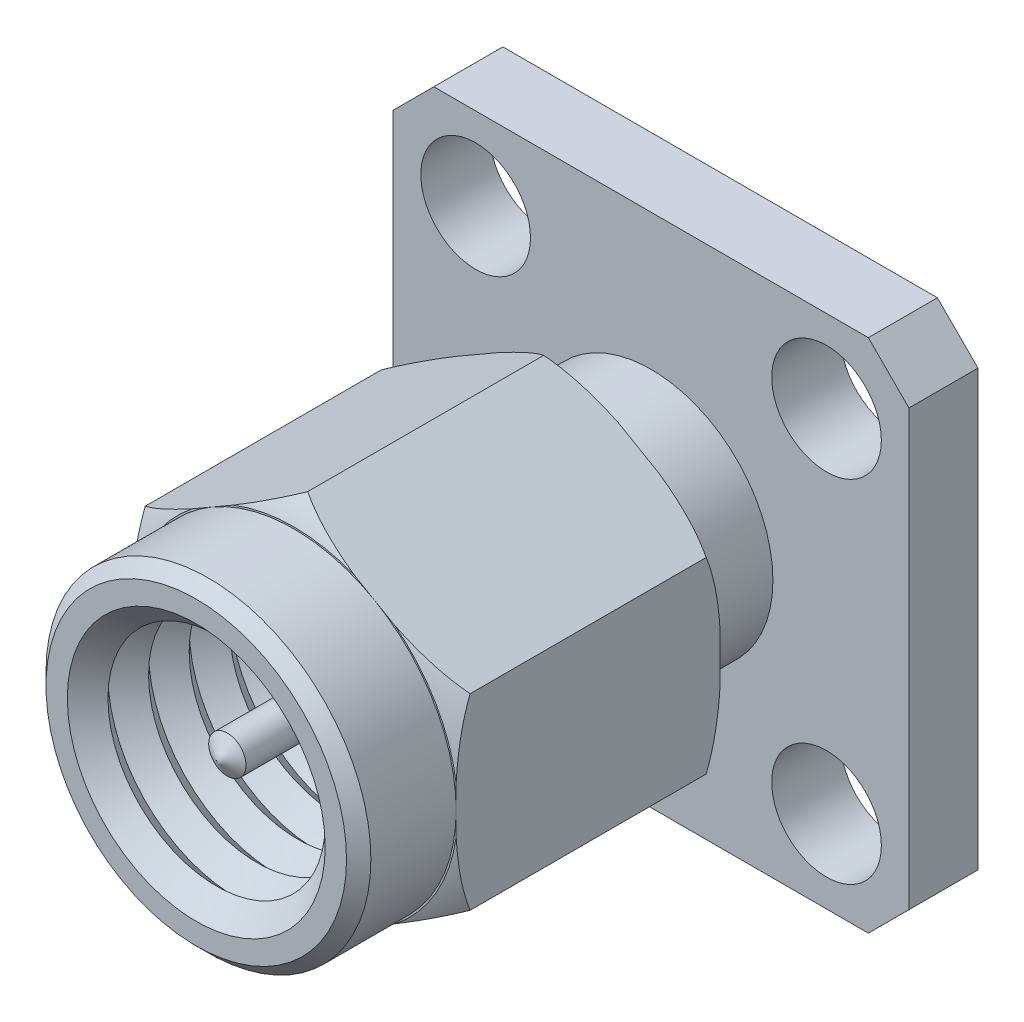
ISO-10303-21;
HEADER;
FILE_DESCRIPTION(('STEP AP214'),'2;1');
FILE_NAME('part.step','',(''),(''),'','','');
FILE_SCHEMA(('AUTOMOTIVE_DESIGN { 1 0 10303 214 1 1 1 1 }'));
ENDSEC;
DATA;
#1=APPLICATION_CONTEXT('core data for automotive mechanical design processes');
#2=APPLICATION_PROTOCOL_DEFINITION('international standard','automotive_design',2000,#1);
#3=PRODUCT_CONTEXT('',#1,'mechanical');
#4=PRODUCT('Part','Part','',(#3));
#5=PRODUCT_RELATED_PRODUCT_CATEGORY('part','',(#4));
#6=PRODUCT_DEFINITION_FORMATION('','',#4);
#7=PRODUCT_DEFINITION_CONTEXT('part definition',#1,'design');
#8=PRODUCT_DEFINITION('design','',#6,#7);
#9=PRODUCT_DEFINITION_SHAPE('','',#8);
#10=(LENGTH_UNIT() NAMED_UNIT(*) SI_UNIT(.MILLI.,.METRE.));
#11=(NAMED_UNIT(*) PLANE_ANGLE_UNIT() SI_UNIT($,.RADIAN.));
#12=(NAMED_UNIT(*) SI_UNIT($,.STERADIAN.) SOLID_ANGLE_UNIT());
#13=UNCERTAINTY_MEASURE_WITH_UNIT(LENGTH_MEASURE(1.E-05),#10,'distance_accuracy_value','');
#14=(GEOMETRIC_REPRESENTATION_CONTEXT(3) GLOBAL_UNCERTAINTY_ASSIGNED_CONTEXT((#13)) GLOBAL_UNIT_ASSIGNED_CONTEXT((#10,
#11,#12)) REPRESENTATION_CONTEXT('',''));
#15=CARTESIAN_POINT('',(0.,0.,0.));
#16=DIRECTION('',(0.,0.,1.));
#17=DIRECTION('',(1.,0.,0.));
#18=AXIS2_PLACEMENT_3D('',#15,#16,#17);
#19=CARTESIAN_POINT('',(-6.35,6.35,1.7));
#20=DIRECTION('',(0.,0.,-1.));
#21=DIRECTION('',(-1.,0.,0.));
#22=AXIS2_PLACEMENT_3D('',#19,#20,#21);
#23=PLANE('',#22);
#24=CARTESIAN_POINT('',(-4.32,4.32,1.7));
#25=DIRECTION('',(0.,0.,1.));
#26=DIRECTION('',(1.,0.,0.));
#27=AXIS2_PLACEMENT_3D('',#24,#25,#26);
#28=CIRCLE('',#27,1.35);
#29=CARTESIAN_POINT('',(-2.97,4.32,1.7));
#30=VERTEX_POINT('',#29);
#31=EDGE_CURVE('E611',#30,#30,#28,.T.);
#32=ORIENTED_EDGE('',*,*,#31,.F.);
#33=EDGE_LOOP('',(#32));
#34=FACE_BOUND('',#33,.T.);
#35=CARTESIAN_POINT('',(4.32,4.32,1.7));
#36=DIRECTION('',(0.,0.,1.));
#37=DIRECTION('',(1.,0.,0.));
#38=AXIS2_PLACEMENT_3D('',#35,#36,#37);
#39=CIRCLE('',#38,1.35);
#40=CARTESIAN_POINT('',(5.67,4.32,1.7));
#41=VERTEX_POINT('',#40);
#42=EDGE_CURVE('E615',#41,#41,#39,.T.);
#43=ORIENTED_EDGE('',*,*,#42,.F.);
#44=EDGE_LOOP('',(#43));
#45=FACE_BOUND('',#44,.T.);
#46=CARTESIAN_POINT('',(0.,0.,1.7));
#47=DIRECTION('',(0.,0.,-1.));
#48=DIRECTION('',(-1.,0.,0.));
#49=AXIS2_PLACEMENT_3D('',#46,#47,#48);
#50=CIRCLE('',#49,3.);
#51=CARTESIAN_POINT('',(-3.,0.,1.7));
#52=VERTEX_POINT('',#51);
#53=EDGE_CURVE('E424',#52,#52,#50,.T.);
#54=ORIENTED_EDGE('',*,*,#53,.T.);
#55=EDGE_LOOP('',(#54));
#56=FACE_BOUND('',#55,.T.);
#57=DIRECTION('',(0.,-1.,0.));
#58=VECTOR('',#57,1.);
#59=CARTESIAN_POINT('',(-6.35,-5.35,1.7));
#60=LINE('',#59,#58);
#61=CARTESIAN_POINT('',(-6.35,5.35,1.7));
#62=VERTEX_POINT('',#61);
#63=CARTESIAN_POINT('',(-6.35,-5.35,1.7));
#64=VERTEX_POINT('',#63);
#65=EDGE_CURVE('E311',#62,#64,#60,.T.);
#66=ORIENTED_EDGE('',*,*,#65,.T.);
#67=DIRECTION('',(0.707106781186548,-0.707106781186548,0.));
#68=VECTOR('',#67,1.);
#69=CARTESIAN_POINT('',(-6.35,-5.35,1.7));
#70=LINE('',#69,#68);
#71=CARTESIAN_POINT('',(-5.35,-6.35,1.7));
#72=VERTEX_POINT('',#71);
#73=EDGE_CURVE('E314',#64,#72,#70,.T.);
#74=ORIENTED_EDGE('',*,*,#73,.T.);
#75=DIRECTION('',(1.,0.,0.));
#76=VECTOR('',#75,1.);
#77=CARTESIAN_POINT('',(-5.35,-6.35,1.7));
#78=LINE('',#77,#76);
#79=CARTESIAN_POINT('',(5.35,-6.35,1.7));
#80=VERTEX_POINT('',#79);
#81=EDGE_CURVE('E316',#72,#80,#78,.T.);
#82=ORIENTED_EDGE('',*,*,#81,.T.);
#83=DIRECTION('',(0.707106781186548,0.707106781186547,0.));
#84=VECTOR('',#83,1.);
#85=CARTESIAN_POINT('',(5.35,-6.35,1.7));
#86=LINE('',#85,#84);
#87=CARTESIAN_POINT('',(6.35,-5.35,1.7));
#88=VERTEX_POINT('',#87);
#89=EDGE_CURVE('E318',#80,#88,#86,.T.);
#90=ORIENTED_EDGE('',*,*,#89,.T.);
#91=DIRECTION('',(0.,1.,0.));
#92=VECTOR('',#91,1.);
#93=CARTESIAN_POINT('',(6.35,-5.35,1.7));
#94=LINE('',#93,#92);
#95=CARTESIAN_POINT('',(6.35,5.35,1.7));
#96=VERTEX_POINT('',#95);
#97=EDGE_CURVE('E320',#88,#96,#94,.T.);
#98=ORIENTED_EDGE('',*,*,#97,.T.);
#99=DIRECTION('',(-0.707106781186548,0.707106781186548,0.));
#100=VECTOR('',#99,1.);
#101=CARTESIAN_POINT('',(5.35,6.35,1.7));
#102=LINE('',#101,#100);
#103=CARTESIAN_POINT('',(5.35,6.35,1.7));
#104=VERTEX_POINT('',#103);
#105=EDGE_CURVE('E322',#96,#104,#102,.T.);
#106=ORIENTED_EDGE('',*,*,#105,.T.);
#107=DIRECTION('',(-1.,0.,0.));
#108=VECTOR('',#107,1.);
#109=CARTESIAN_POINT('',(-5.35,6.35,1.7));
#110=LINE('',#109,#108);
#111=CARTESIAN_POINT('',(-5.35,6.35,1.7));
#112=VERTEX_POINT('',#111);
#113=EDGE_CURVE('E324',#104,#112,#110,.T.);
#114=ORIENTED_EDGE('',*,*,#113,.T.);
#115=DIRECTION('',(-0.707106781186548,-0.707106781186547,0.));
#116=VECTOR('',#115,1.);
#117=CARTESIAN_POINT('',(-6.35,5.35,1.7));
#118=LINE('',#117,#116);
#119=EDGE_CURVE('E326',#112,#62,#118,.T.);
#120=ORIENTED_EDGE('',*,*,#119,.T.);
#121=EDGE_LOOP('',(#66,#74,#82,#90,#98,#106,#114,#120));
#122=FACE_BOUND('',#121,.T.);
#123=CARTESIAN_POINT('',(4.32,-4.32,1.7));
#124=DIRECTION('',(0.,0.,1.));
#125=DIRECTION('',(1.,0.,0.));
#126=AXIS2_PLACEMENT_3D('',#123,#124,#125);
#127=CIRCLE('',#126,1.35);
#128=CARTESIAN_POINT('',(5.67,-4.32,1.7));
#129=VERTEX_POINT('',#128);
#130=EDGE_CURVE('E624',#129,#129,#127,.T.);
#131=ORIENTED_EDGE('',*,*,#130,.F.);
#132=EDGE_LOOP('',(#131));
#133=FACE_BOUND('',#132,.T.);
#134=CARTESIAN_POINT('',(-4.32,-4.32,1.7));
#135=DIRECTION('',(0.,0.,1.));
#136=DIRECTION('',(1.,0.,0.));
#137=AXIS2_PLACEMENT_3D('',#134,#135,#136);
#138=CIRCLE('',#137,1.35);
#139=CARTESIAN_POINT('',(-2.97,-4.32,1.7));
#140=VERTEX_POINT('',#139);
#141=EDGE_CURVE('E627',#140,#140,#138,.T.);
#142=ORIENTED_EDGE('',*,*,#141,.F.);
#143=EDGE_LOOP('',(#142));
#144=FACE_BOUND('',#143,.T.);
#145=ADVANCED_FACE('F30',(#34,#45,#56,#122,#133,#144),#23,.F.);
#146=CARTESIAN_POINT('',(0.,0.,12.4));
#147=DIRECTION('',(0.,0.,1.));
#148=DIRECTION('',(1.,0.,0.));
#149=AXIS2_PLACEMENT_3D('',#146,#147,#148);
#150=CYLINDRICAL_SURFACE('',#149,4.);
#151=CARTESIAN_POINT('',(0.,0.,10.5));
#152=DIRECTION('',(0.,0.,1.));
#153=DIRECTION('',(1.,0.,0.));
#154=AXIS2_PLACEMENT_3D('',#151,#152,#153);
#155=CIRCLE('',#154,4.);
#156=CARTESIAN_POINT('',(2.,-3.46410161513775,10.5));
#157=VERTEX_POINT('',#156);
#158=CARTESIAN_POINT('',(4.,0.,10.5));
#159=VERTEX_POINT('',#158);
#160=EDGE_CURVE('E427',#157,#159,#155,.T.);
#161=ORIENTED_EDGE('',*,*,#160,.T.);
#162=CARTESIAN_POINT('',(2.,3.46410161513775,10.5));
#163=VERTEX_POINT('',#162);
#164=EDGE_CURVE('E431',#159,#163,#155,.T.);
#165=ORIENTED_EDGE('',*,*,#164,.T.);
#166=CARTESIAN_POINT('',(-2.,3.46410161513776,10.5));
#167=VERTEX_POINT('',#166);
#168=EDGE_CURVE('E701',#163,#167,#155,.T.);
#169=ORIENTED_EDGE('',*,*,#168,.T.);
#170=CARTESIAN_POINT('',(-4.,0.,10.5));
#171=VERTEX_POINT('',#170);
#172=EDGE_CURVE('E700',#167,#171,#155,.T.);
#173=ORIENTED_EDGE('',*,*,#172,.T.);
#174=CARTESIAN_POINT('',(-2.,-3.46410161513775,10.5));
#175=VERTEX_POINT('',#174);
#176=EDGE_CURVE('E699',#171,#175,#155,.T.);
#177=ORIENTED_EDGE('',*,*,#176,.T.);
#178=EDGE_CURVE('E430',#175,#157,#155,.T.);
#179=ORIENTED_EDGE('',*,*,#178,.T.);
#180=EDGE_LOOP('',(#161,#165,#169,#173,#177,#179));
#181=FACE_BOUND('',#180,.T.);
#182=CARTESIAN_POINT('',(0.,0.,12.6));
#183=DIRECTION('',(0.,0.,1.));
#184=DIRECTION('',(1.,0.,0.));
#185=AXIS2_PLACEMENT_3D('',#182,#183,#184);
#186=CIRCLE('',#185,4.);
#187=CARTESIAN_POINT('',(4.,0.,12.6));
#188=VERTEX_POINT('',#187);
#189=EDGE_CURVE('E406',#188,#188,#186,.T.);
#190=ORIENTED_EDGE('',*,*,#189,.F.);
#191=EDGE_LOOP('',(#190));
#192=FACE_BOUND('',#191,.T.);
#193=ADVANCED_FACE('F600',(#181,#192),#150,.T.);
#194=CARTESIAN_POINT('',(0.,0.,12.6));
#195=DIRECTION('',(0.,0.,-1.));
#196=DIRECTION('',(-1.,0.,0.));
#197=AXIS2_PLACEMENT_3D('',#194,#195,#196);
#198=CONICAL_SURFACE('',#197,4.,0.78539816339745);
#199=CARTESIAN_POINT('',(0.,0.,12.9));
#200=DIRECTION('',(0.,0.,1.));
#201=DIRECTION('',(1.,0.,0.));
#202=AXIS2_PLACEMENT_3D('',#199,#200,#201);
#203=CIRCLE('',#202,3.7);
#204=CARTESIAN_POINT('',(3.7,0.,12.9));
#205=VERTEX_POINT('',#204);
#206=EDGE_CURVE('E403',#205,#205,#203,.T.);
#207=ORIENTED_EDGE('',*,*,#206,.F.);
#208=EDGE_LOOP('',(#207));
#209=FACE_BOUND('',#208,.T.);
#210=ORIENTED_EDGE('',*,*,#189,.T.);
#211=EDGE_LOOP('',(#210));
#212=FACE_BOUND('',#211,.T.);
#213=ADVANCED_FACE('F605',(#209,#212),#198,.T.);
#214=CARTESIAN_POINT('',(0.,3.7,12.9));
#215=DIRECTION('',(0.,0.,-1.));
#216=DIRECTION('',(-1.,0.,0.));
#217=AXIS2_PLACEMENT_3D('',#214,#215,#216);
#218=PLANE('',#217);
#219=CARTESIAN_POINT('',(0.,0.,12.9));
#220=DIRECTION('',(0.,0.,1.));
#221=DIRECTION('',(1.,0.,0.));
#222=AXIS2_PLACEMENT_3D('',#219,#220,#221);
#223=CIRCLE('',#222,3.175);
#224=CARTESIAN_POINT('',(3.175,0.,12.9));
#225=VERTEX_POINT('',#224);
#226=EDGE_CURVE('E400',#225,#225,#223,.T.);
#227=ORIENTED_EDGE('',*,*,#226,.F.);
#228=EDGE_LOOP('',(#227));
#229=FACE_BOUND('',#228,.T.);
#230=ORIENTED_EDGE('',*,*,#206,.T.);
#231=EDGE_LOOP('',(#230));
#232=FACE_BOUND('',#231,.T.);
#233=ADVANCED_FACE('F1054',(#229,#232),#218,.F.);
#234=CARTESIAN_POINT('',(0.,0.,12.9));
#235=DIRECTION('',(0.,0.,1.));
#236=DIRECTION('',(1.,0.,0.));
#237=AXIS2_PLACEMENT_3D('',#234,#235,#236);
#238=CONICAL_SURFACE('',#237,3.175,0.785398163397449);
#239=CARTESIAN_POINT('',(0.,0.,12.4));
#240=DIRECTION('',(0.,0.,1.));
#241=DIRECTION('',(1.,0.,0.));
#242=AXIS2_PLACEMENT_3D('',#239,#240,#241);
#243=CIRCLE('',#242,2.675);
#244=CARTESIAN_POINT('',(2.675,0.,12.4));
#245=VERTEX_POINT('',#244);
#246=EDGE_CURVE('E397',#245,#245,#243,.T.);
#247=ORIENTED_EDGE('',*,*,#246,.F.);
#248=EDGE_LOOP('',(#247));
#249=FACE_BOUND('',#248,.T.);
#250=ORIENTED_EDGE('',*,*,#226,.T.);
#251=EDGE_LOOP('',(#250));
#252=FACE_BOUND('',#251,.T.);
#253=ADVANCED_FACE('F1061',(#249,#252),#238,.F.);
#254=CARTESIAN_POINT('',(0.,0.,12.4));
#255=DIRECTION('',(0.,0.,-1.));
#256=DIRECTION('',(-1.,0.,0.));
#257=AXIS2_PLACEMENT_3D('',#254,#255,#256);
#258=CONICAL_SURFACE('',#257,2.675,0.785398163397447);
#259=CARTESIAN_POINT('',(0.,0.,11.9));
#260=DIRECTION('',(0.,0.,1.));
#261=DIRECTION('',(1.,0.,0.));
#262=AXIS2_PLACEMENT_3D('',#259,#260,#261);
#263=CIRCLE('',#262,3.175);
#264=CARTESIAN_POINT('',(3.175,0.,11.9));
#265=VERTEX_POINT('',#264);
#266=EDGE_CURVE('E394',#265,#265,#263,.T.);
#267=ORIENTED_EDGE('',*,*,#266,.F.);
#268=EDGE_LOOP('',(#267));
#269=FACE_BOUND('',#268,.T.);
#270=ORIENTED_EDGE('',*,*,#246,.T.);
#271=EDGE_LOOP('',(#270));
#272=FACE_BOUND('',#271,.T.);
#273=ADVANCED_FACE('F1069',(#269,#272),#258,.F.);
#274=CARTESIAN_POINT('',(0.,0.,11.9));
#275=DIRECTION('',(0.,0.,1.));
#276=DIRECTION('',(1.,0.,0.));
#277=AXIS2_PLACEMENT_3D('',#274,#275,#276);
#278=CONICAL_SURFACE('',#277,3.175,0.785398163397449);
#279=CARTESIAN_POINT('',(0.,0.,11.4));
#280=DIRECTION('',(0.,0.,1.));
#281=DIRECTION('',(1.,0.,0.));
#282=AXIS2_PLACEMENT_3D('',#279,#280,#281);
#283=CIRCLE('',#282,2.675);
#284=CARTESIAN_POINT('',(2.675,0.,11.4));
#285=VERTEX_POINT('',#284);
#286=EDGE_CURVE('E391',#285,#285,#283,.T.);
#287=ORIENTED_EDGE('',*,*,#286,.F.);
#288=EDGE_LOOP('',(#287));
#289=FACE_BOUND('',#288,.T.);
#290=ORIENTED_EDGE('',*,*,#266,.T.);
#291=EDGE_LOOP('',(#290));
#292=FACE_BOUND('',#291,.T.);
#293=ADVANCED_FACE('F1077',(#289,#292),#278,.F.);
#294=CARTESIAN_POINT('',(0.,0.,11.4));
#295=DIRECTION('',(0.,0.,-1.));
#296=DIRECTION('',(-1.,0.,0.));
#297=AXIS2_PLACEMENT_3D('',#294,#295,#296);
#298=CONICAL_SURFACE('',#297,2.675,0.785398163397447);
#299=CARTESIAN_POINT('',(0.,0.,10.9));
#300=DIRECTION('',(0.,0.,1.));
#301=DIRECTION('',(1.,0.,0.));
#302=AXIS2_PLACEMENT_3D('',#299,#300,#301);
#303=CIRCLE('',#302,3.175);
#304=CARTESIAN_POINT('',(3.175,0.,10.9));
#305=VERTEX_POINT('',#304);
#306=EDGE_CURVE('E388',#305,#305,#303,.T.);
#307=ORIENTED_EDGE('',*,*,#306,.F.);
#308=EDGE_LOOP('',(#307));
#309=FACE_BOUND('',#308,.T.);
#310=ORIENTED_EDGE('',*,*,#286,.T.);
#311=EDGE_LOOP('',(#310));
#312=FACE_BOUND('',#311,.T.);
#313=ADVANCED_FACE('F1085',(#309,#312),#298,.F.);
#314=CARTESIAN_POINT('',(0.,0.,10.9));
#315=DIRECTION('',(0.,0.,1.));
#316=DIRECTION('',(1.,0.,0.));
#317=AXIS2_PLACEMENT_3D('',#314,#315,#316);
#318=CONICAL_SURFACE('',#317,3.175,0.785398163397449);
#319=CARTESIAN_POINT('',(0.,0.,10.4));
#320=DIRECTION('',(0.,0.,1.));
#321=DIRECTION('',(1.,0.,0.));
#322=AXIS2_PLACEMENT_3D('',#319,#320,#321);
#323=CIRCLE('',#322,2.675);
#324=CARTESIAN_POINT('',(2.675,0.,10.4));
#325=VERTEX_POINT('',#324);
#326=EDGE_CURVE('E385',#325,#325,#323,.T.);
#327=ORIENTED_EDGE('',*,*,#326,.F.);
#328=EDGE_LOOP('',(#327));
#329=FACE_BOUND('',#328,.T.);
#330=ORIENTED_EDGE('',*,*,#306,.T.);
#331=EDGE_LOOP('',(#330));
#332=FACE_BOUND('',#331,.T.);
#333=ADVANCED_FACE('F1093',(#329,#332),#318,.F.);
#334=CARTESIAN_POINT('',(0.,0.,10.4));
#335=DIRECTION('',(0.,0.,-1.));
#336=DIRECTION('',(-1.,0.,0.));
#337=AXIS2_PLACEMENT_3D('',#334,#335,#336);
#338=CONICAL_SURFACE('',#337,2.675,0.785398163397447);
#339=CARTESIAN_POINT('',(0.,0.,9.9));
#340=DIRECTION('',(0.,0.,1.));
#341=DIRECTION('',(1.,0.,0.));
#342=AXIS2_PLACEMENT_3D('',#339,#340,#341);
#343=CIRCLE('',#342,3.175);
#344=CARTESIAN_POINT('',(3.175,0.,9.9));
#345=VERTEX_POINT('',#344);
#346=EDGE_CURVE('E382',#345,#345,#343,.T.);
#347=ORIENTED_EDGE('',*,*,#346,.F.);
#348=EDGE_LOOP('',(#347));
#349=FACE_BOUND('',#348,.T.);
#350=ORIENTED_EDGE('',*,*,#326,.T.);
#351=EDGE_LOOP('',(#350));
#352=FACE_BOUND('',#351,.T.);
#353=ADVANCED_FACE('F1101',(#349,#352),#338,.F.);
#354=CARTESIAN_POINT('',(0.,0.,9.9));
#355=DIRECTION('',(0.,0.,1.));
#356=DIRECTION('',(1.,0.,0.));
#357=AXIS2_PLACEMENT_3D('',#354,#355,#356);
#358=CONICAL_SURFACE('',#357,3.175,0.785398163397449);
#359=CARTESIAN_POINT('',(0.,0.,9.4));
#360=DIRECTION('',(0.,0.,1.));
#361=DIRECTION('',(1.,0.,0.));
#362=AXIS2_PLACEMENT_3D('',#359,#360,#361);
#363=CIRCLE('',#362,2.675);
#364=CARTESIAN_POINT('',(2.675,0.,9.4));
#365=VERTEX_POINT('',#364);
#366=EDGE_CURVE('E379',#365,#365,#363,.T.);
#367=ORIENTED_EDGE('',*,*,#366,.F.);
#368=EDGE_LOOP('',(#367));
#369=FACE_BOUND('',#368,.T.);
#370=ORIENTED_EDGE('',*,*,#346,.T.);
#371=EDGE_LOOP('',(#370));
#372=FACE_BOUND('',#371,.T.);
#373=ADVANCED_FACE('F1109',(#369,#372),#358,.F.);
#374=CARTESIAN_POINT('',(0.,0.,9.4));
#375=DIRECTION('',(0.,0.,-1.));
#376=DIRECTION('',(-1.,0.,0.));
#377=AXIS2_PLACEMENT_3D('',#374,#375,#376);
#378=CONICAL_SURFACE('',#377,2.675,0.785398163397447);
#379=CARTESIAN_POINT('',(0.,0.,8.9));
#380=DIRECTION('',(0.,0.,1.));
#381=DIRECTION('',(1.,0.,0.));
#382=AXIS2_PLACEMENT_3D('',#379,#380,#381);
#383=CIRCLE('',#382,3.175);
#384=CARTESIAN_POINT('',(3.175,0.,8.9));
#385=VERTEX_POINT('',#384);
#386=EDGE_CURVE('E376',#385,#385,#383,.T.);
#387=ORIENTED_EDGE('',*,*,#386,.F.);
#388=EDGE_LOOP('',(#387));
#389=FACE_BOUND('',#388,.T.);
#390=ORIENTED_EDGE('',*,*,#366,.T.);
#391=EDGE_LOOP('',(#390));
#392=FACE_BOUND('',#391,.T.);
#393=ADVANCED_FACE('F1117',(#389,#392),#378,.F.);
#394=CARTESIAN_POINT('',(0.,0.,8.9));
#395=DIRECTION('',(0.,0.,1.));
#396=DIRECTION('',(1.,0.,0.));
#397=AXIS2_PLACEMENT_3D('',#394,#395,#396);
#398=CONICAL_SURFACE('',#397,3.175,0.785398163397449);
#399=CARTESIAN_POINT('',(0.,0.,8.4));
#400=DIRECTION('',(0.,0.,1.));
#401=DIRECTION('',(1.,0.,0.));
#402=AXIS2_PLACEMENT_3D('',#399,#400,#401);
#403=CIRCLE('',#402,2.675);
#404=CARTESIAN_POINT('',(2.675,0.,8.4));
#405=VERTEX_POINT('',#404);
#406=EDGE_CURVE('E373',#405,#405,#403,.T.);
#407=ORIENTED_EDGE('',*,*,#406,.F.);
#408=EDGE_LOOP('',(#407));
#409=FACE_BOUND('',#408,.T.);
#410=ORIENTED_EDGE('',*,*,#386,.T.);
#411=EDGE_LOOP('',(#410));
#412=FACE_BOUND('',#411,.T.);
#413=ADVANCED_FACE('F1125',(#409,#412),#398,.F.);
#414=CARTESIAN_POINT('',(0.,0.,8.4));
#415=DIRECTION('',(0.,0.,-1.));
#416=DIRECTION('',(-1.,0.,0.));
#417=AXIS2_PLACEMENT_3D('',#414,#415,#416);
#418=CONICAL_SURFACE('',#417,2.675,0.785398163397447);
#419=CARTESIAN_POINT('',(0.,0.,7.9));
#420=DIRECTION('',(0.,0.,1.));
#421=DIRECTION('',(1.,0.,0.));
#422=AXIS2_PLACEMENT_3D('',#419,#420,#421);
#423=CIRCLE('',#422,3.175);
#424=CARTESIAN_POINT('',(3.175,0.,7.9));
#425=VERTEX_POINT('',#424);
#426=EDGE_CURVE('E370',#425,#425,#423,.T.);
#427=ORIENTED_EDGE('',*,*,#426,.F.);
#428=EDGE_LOOP('',(#427));
#429=FACE_BOUND('',#428,.T.);
#430=ORIENTED_EDGE('',*,*,#406,.T.);
#431=EDGE_LOOP('',(#430));
#432=FACE_BOUND('',#431,.T.);
#433=ADVANCED_FACE('F1133',(#429,#432),#418,.F.);
#434=CARTESIAN_POINT('',(0.,0.,7.9));
#435=DIRECTION('',(0.,0.,1.));
#436=DIRECTION('',(1.,0.,0.));
#437=AXIS2_PLACEMENT_3D('',#434,#435,#436);
#438=CONICAL_SURFACE('',#437,3.175,0.785398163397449);
#439=CARTESIAN_POINT('',(0.,0.,7.40000000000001));
#440=DIRECTION('',(0.,0.,1.));
#441=DIRECTION('',(1.,0.,0.));
#442=AXIS2_PLACEMENT_3D('',#439,#440,#441);
#443=CIRCLE('',#442,2.675);
#444=CARTESIAN_POINT('',(2.675,0.,7.40000000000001));
#445=VERTEX_POINT('',#444);
#446=EDGE_CURVE('E367',#445,#445,#443,.T.);
#447=ORIENTED_EDGE('',*,*,#446,.F.);
#448=EDGE_LOOP('',(#447));
#449=FACE_BOUND('',#448,.T.);
#450=ORIENTED_EDGE('',*,*,#426,.T.);
#451=EDGE_LOOP('',(#450));
#452=FACE_BOUND('',#451,.T.);
#453=ADVANCED_FACE('F1141',(#449,#452),#438,.F.);
#454=CARTESIAN_POINT('',(0.,0.,7.40000000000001));
#455=DIRECTION('',(0.,0.,-1.));
#456=DIRECTION('',(-1.,0.,0.));
#457=AXIS2_PLACEMENT_3D('',#454,#455,#456);
#458=CONICAL_SURFACE('',#457,2.675,0.785398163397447);
#459=CARTESIAN_POINT('',(0.,0.,6.9));
#460=DIRECTION('',(0.,0.,1.));
#461=DIRECTION('',(1.,0.,0.));
#462=AXIS2_PLACEMENT_3D('',#459,#460,#461);
#463=CIRCLE('',#462,3.175);
#464=CARTESIAN_POINT('',(3.175,0.,6.9));
#465=VERTEX_POINT('',#464);
#466=EDGE_CURVE('E364',#465,#465,#463,.T.);
#467=ORIENTED_EDGE('',*,*,#466,.F.);
#468=EDGE_LOOP('',(#467));
#469=FACE_BOUND('',#468,.T.);
#470=ORIENTED_EDGE('',*,*,#446,.T.);
#471=EDGE_LOOP('',(#470));
#472=FACE_BOUND('',#471,.T.);
#473=ADVANCED_FACE('F1149',(#469,#472),#458,.F.);
#474=CARTESIAN_POINT('',(0.,0.,6.9));
#475=DIRECTION('',(0.,0.,1.));
#476=DIRECTION('',(1.,0.,0.));
#477=AXIS2_PLACEMENT_3D('',#474,#475,#476);
#478=CONICAL_SURFACE('',#477,3.175,0.785398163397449);
#479=CARTESIAN_POINT('',(0.,0.,6.40000000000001));
#480=DIRECTION('',(0.,0.,1.));
#481=DIRECTION('',(1.,0.,0.));
#482=AXIS2_PLACEMENT_3D('',#479,#480,#481);
#483=CIRCLE('',#482,2.675);
#484=CARTESIAN_POINT('',(2.675,0.,6.40000000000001));
#485=VERTEX_POINT('',#484);
#486=EDGE_CURVE('E361',#485,#485,#483,.T.);
#487=ORIENTED_EDGE('',*,*,#486,.F.);
#488=EDGE_LOOP('',(#487));
#489=FACE_BOUND('',#488,.T.);
#490=ORIENTED_EDGE('',*,*,#466,.T.);
#491=EDGE_LOOP('',(#490));
#492=FACE_BOUND('',#491,.T.);
#493=ADVANCED_FACE('F1157',(#489,#492),#478,.F.);
#494=CARTESIAN_POINT('',(0.,0.,6.40000000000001));
#495=DIRECTION('',(0.,0.,-1.));
#496=DIRECTION('',(-1.,0.,0.));
#497=AXIS2_PLACEMENT_3D('',#494,#495,#496);
#498=CONICAL_SURFACE('',#497,2.675,0.785398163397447);
#499=CARTESIAN_POINT('',(0.,0.,5.90000000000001));
#500=DIRECTION('',(0.,0.,1.));
#501=DIRECTION('',(1.,0.,0.));
#502=AXIS2_PLACEMENT_3D('',#499,#500,#501);
#503=CIRCLE('',#502,3.175);
#504=CARTESIAN_POINT('',(3.175,0.,5.90000000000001));
#505=VERTEX_POINT('',#504);
#506=EDGE_CURVE('E358',#505,#505,#503,.T.);
#507=ORIENTED_EDGE('',*,*,#506,.F.);
#508=EDGE_LOOP('',(#507));
#509=FACE_BOUND('',#508,.T.);
#510=ORIENTED_EDGE('',*,*,#486,.T.);
#511=EDGE_LOOP('',(#510));
#512=FACE_BOUND('',#511,.T.);
#513=ADVANCED_FACE('F1165',(#509,#512),#498,.F.);
#514=CARTESIAN_POINT('',(0.,0.46,5.90000000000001));
#515=DIRECTION('',(0.,0.,-1.));
#516=DIRECTION('',(-1.,0.,0.));
#517=AXIS2_PLACEMENT_3D('',#514,#515,#516);
#518=PLANE('',#517);
#519=CARTESIAN_POINT('',(0.,0.,5.90000000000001));
#520=DIRECTION('',(0.,0.,1.));
#521=DIRECTION('',(1.,0.,0.));
#522=AXIS2_PLACEMENT_3D('',#519,#520,#521);
#523=CIRCLE('',#522,0.46);
#524=CARTESIAN_POINT('',(0.46,0.,5.90000000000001));
#525=VERTEX_POINT('',#524);
#526=EDGE_CURVE('E355',#525,#525,#523,.T.);
#527=ORIENTED_EDGE('',*,*,#526,.F.);
#528=EDGE_LOOP('',(#527));
#529=FACE_BOUND('',#528,.T.);
#530=ORIENTED_EDGE('',*,*,#506,.T.);
#531=EDGE_LOOP('',(#530));
#532=FACE_BOUND('',#531,.T.);
#533=ADVANCED_FACE('F1173',(#529,#532),#518,.F.);
#534=CARTESIAN_POINT('',(0.,0.,12.4));
#535=DIRECTION('',(0.,0.,1.));
#536=DIRECTION('',(1.,0.,0.));
#537=AXIS2_PLACEMENT_3D('',#534,#535,#536);
#538=CYLINDRICAL_SURFACE('',#537,0.46);
#539=CARTESIAN_POINT('',(0.,0.,12.1344188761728));
#540=DIRECTION('',(0.,0.,1.));
#541=DIRECTION('',(1.,0.,0.));
#542=AXIS2_PLACEMENT_3D('',#539,#540,#541);
#543=CIRCLE('',#542,0.46);
#544=CARTESIAN_POINT('',(0.46,0.,12.1344188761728));
#545=VERTEX_POINT('',#544);
#546=EDGE_CURVE('E352',#545,#545,#543,.T.);
#547=ORIENTED_EDGE('',*,*,#546,.F.);
#548=EDGE_LOOP('',(#547));
#549=FACE_BOUND('',#548,.T.);
#550=ORIENTED_EDGE('',*,*,#526,.T.);
#551=EDGE_LOOP('',(#550));
#552=FACE_BOUND('',#551,.T.);
#553=ADVANCED_FACE('F1181',(#549,#552),#538,.T.);
#554=CARTESIAN_POINT('',(0.,0.,12.1344188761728));
#555=DIRECTION('',(0.,0.,-1.));
#556=DIRECTION('',(-1.,0.,0.));
#557=AXIS2_PLACEMENT_3D('',#554,#555,#556);
#558=CONICAL_SURFACE('',#557,0.46,1.0471975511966);
#559=CARTESIAN_POINT('',(0.,0.,12.4));
#560=VERTEX_POINT('',#559);
#561=VERTEX_LOOP('',#560);
#562=FACE_BOUND('',#561,.T.);
#563=ORIENTED_EDGE('',*,*,#546,.T.);
#564=EDGE_LOOP('',(#563));
#565=FACE_BOUND('',#564,.T.);
#566=ADVANCED_FACE('F556',(#562,#565),#558,.T.);
#567=CARTESIAN_POINT('',(0.,4.61880215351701,10.5));
#568=DIRECTION('',(0.5,0.866025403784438,0.));
#569=DIRECTION('',(-0.866025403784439,0.5,0.));
#570=AXIS2_PLACEMENT_3D('',#567,#568,#569);
#571=PLANE('',#570);
#572=CARTESIAN_POINT('',(2.49714665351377,3.17707386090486,3.99980000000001));
#573=CARTESIAN_POINT('',(2.56126030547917,3.1400578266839,4.0042871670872));
#574=CARTESIAN_POINT('',(2.6253260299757,3.1030694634,4.00969043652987));
#575=CARTESIAN_POINT('',(2.75331772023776,3.02917342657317,4.02253512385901));
#576=CARTESIAN_POINT('',(2.81724365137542,2.99226577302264,4.02997699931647));
#577=CARTESIAN_POINT('',(3.00789604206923,2.88219256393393,4.05555778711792));
#578=CARTESIAN_POINT('',(3.1343090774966,2.80920796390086,4.07700358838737));
#579=CARTESIAN_POINT('',(3.38568708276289,2.66407480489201,4.13100578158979));
#580=CARTESIAN_POINT('',(3.51064862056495,2.59192822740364,4.16358447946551));
#581=CARTESIAN_POINT('',(3.69599607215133,2.48491782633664,4.22286991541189));
#582=CARTESIAN_POINT('',(3.75761549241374,2.44934183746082,4.24445047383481));
#583=CARTESIAN_POINT('',(3.87978797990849,2.37880551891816,4.29146018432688));
#584=CARTESIAN_POINT('',(3.94034026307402,2.3438456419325,4.31689204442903));
#585=CARTESIAN_POINT('',(4.00020000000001,2.30928560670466,4.34442179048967));
#586=B_SPLINE_CURVE_WITH_KNOTS('',3,(#572,#573,#574,#575,#576,#577,#578,#579,#580,#581,#582,
#583,#584,#585),.UNSPECIFIED.,.F.,.F.,(4,2,2,2,2,2,4),(0.,0.222495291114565,0.445040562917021,
0.887318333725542,1.33048750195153,1.5534465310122,1.77656306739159),.UNSPECIFIED.);
#587=CARTESIAN_POINT('',(2.5,3.17542648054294,4.));
#588=VERTEX_POINT('',#587);
#589=CARTESIAN_POINT('',(4.,2.30940107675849,4.34432980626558));
#590=VERTEX_POINT('',#589);
#591=EDGE_CURVE('E492',#588,#590,#586,.T.);
#592=ORIENTED_EDGE('',*,*,#591,.F.);
#593=DIRECTION('',(0.866025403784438,-0.5,0.));
#594=VECTOR('',#593,1.);
#595=CARTESIAN_POINT('',(0.,4.61880215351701,4.));
#596=LINE('',#595,#594);
#597=CARTESIAN_POINT('',(1.50000000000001,3.75277674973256,4.));
#598=VERTEX_POINT('',#597);
#599=EDGE_CURVE('E551',#598,#588,#596,.T.);
#600=ORIENTED_EDGE('',*,*,#599,.F.);
#601=CARTESIAN_POINT('',(-0.000199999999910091,4.61891762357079,4.34442179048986));
#602=CARTESIAN_POINT('',(0.0596597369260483,4.58435758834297,4.31689204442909));
#603=CARTESIAN_POINT('',(0.120212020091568,4.54939771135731,4.29146018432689));
#604=CARTESIAN_POINT('',(0.242384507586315,4.47886139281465,4.24445047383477));
#605=CARTESIAN_POINT('',(0.304003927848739,4.44328540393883,4.22286991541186));
#606=CARTESIAN_POINT('',(0.489351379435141,4.33627500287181,4.1635844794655));
#607=CARTESIAN_POINT('',(0.614312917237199,4.26412842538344,4.13100578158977));
#608=CARTESIAN_POINT('',(0.865690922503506,4.11899526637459,4.07700358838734));
#609=CARTESIAN_POINT('',(0.992103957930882,4.04601066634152,4.0555577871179));
#610=CARTESIAN_POINT('',(1.18275634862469,3.9359374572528,4.02997699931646));
#611=CARTESIAN_POINT('',(1.24668227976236,3.89902980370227,4.02253512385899));
#612=CARTESIAN_POINT('',(1.37467397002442,3.82513376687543,4.00969043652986));
#613=CARTESIAN_POINT('',(1.43873969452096,3.78814540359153,4.00428716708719));
#614=CARTESIAN_POINT('',(1.50285334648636,3.75112936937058,3.9998));
#615=B_SPLINE_CURVE_WITH_KNOTS('',3,(#601,#602,#603,#604,#605,#606,#607,#608,#609,#610,#611,
#612,#613,#614),.UNSPECIFIED.,.F.,.F.,(4,2,2,2,2,2,4),(0.,0.22311653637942,0.446075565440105,
0.889244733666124,1.33152250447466,1.55406777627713,1.7765630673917),.UNSPECIFIED.);
#616=CARTESIAN_POINT('',(0.,4.618802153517,4.34432980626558));
#617=VERTEX_POINT('',#616);
#618=EDGE_CURVE('E519',#617,#598,#615,.T.);
#619=ORIENTED_EDGE('',*,*,#618,.F.);
#620=DIRECTION('',(0.,0.,-1.));
#621=VECTOR('',#620,1.);
#622=CARTESIAN_POINT('',(0.,4.61880215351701,10.5));
#623=LINE('',#622,#621);
#624=CARTESIAN_POINT('',(-1.15499865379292E-11,4.61880215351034,10.1556701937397));
#625=VERTEX_POINT('',#624);
#626=EDGE_CURVE('E279',#625,#617,#623,.T.);
#627=ORIENTED_EDGE('',*,*,#626,.F.);
#628=CARTESIAN_POINT('',(1.50285334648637,3.75112936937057,10.5002));
#629=CARTESIAN_POINT('',(1.43873969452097,3.78814540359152,10.4957128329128));
#630=CARTESIAN_POINT('',(1.37467397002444,3.82513376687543,10.4903095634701));
#631=CARTESIAN_POINT('',(1.24668227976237,3.89902980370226,10.477464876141));
#632=CARTESIAN_POINT('',(1.18275634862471,3.93593745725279,10.4700230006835));
#633=CARTESIAN_POINT('',(0.992103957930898,4.04601066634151,10.4444422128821));
#634=CARTESIAN_POINT('',(0.865690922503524,4.11899526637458,10.4229964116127));
#635=CARTESIAN_POINT('',(0.614312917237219,4.26412842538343,10.3689942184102));
#636=CARTESIAN_POINT('',(0.489351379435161,4.3362750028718,10.3364155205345));
#637=CARTESIAN_POINT('',(0.304003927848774,4.44328540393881,10.2771300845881));
#638=CARTESIAN_POINT('',(0.242384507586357,4.47886139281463,10.2555495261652));
#639=CARTESIAN_POINT('',(0.120212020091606,4.54939771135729,10.2085398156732));
#640=CARTESIAN_POINT('',(0.0596597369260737,4.58435758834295,10.183107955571));
#641=CARTESIAN_POINT('',(-0.000199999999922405,4.6189176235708,10.1555782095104));
#642=B_SPLINE_CURVE_WITH_KNOTS('',3,(#628,#629,#630,#631,#632,#633,#634,#635,#636,#637,#638,
#639,#640,#641),.UNSPECIFIED.,.F.,.F.,(4,2,2,2,2,2,4),(0.,0.222495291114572,0.445040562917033,
0.887318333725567,1.33048750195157,1.55344653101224,1.77656306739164),.UNSPECIFIED.);
#643=CARTESIAN_POINT('',(1.50000000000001,3.75277674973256,10.5));
#644=VERTEX_POINT('',#643);
#645=EDGE_CURVE('E546',#644,#625,#642,.T.);
#646=ORIENTED_EDGE('',*,*,#645,.F.);
#647=DIRECTION('',(0.866025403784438,-0.5,0.));
#648=VECTOR('',#647,1.);
#649=CARTESIAN_POINT('',(0.,4.61880215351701,10.5));
#650=LINE('',#649,#648);
#651=EDGE_CURVE('E261',#644,#163,#650,.T.);
#652=ORIENTED_EDGE('',*,*,#651,.T.);
#653=CARTESIAN_POINT('',(2.49999999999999,3.17542648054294,10.5));
#654=VERTEX_POINT('',#653);
#655=EDGE_CURVE('E255',#163,#654,#650,.T.);
#656=ORIENTED_EDGE('',*,*,#655,.T.);
#657=CARTESIAN_POINT('',(4.0002,2.30928560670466,10.1555782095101));
#658=CARTESIAN_POINT('',(3.94034026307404,2.34384564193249,10.1831079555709));
#659=CARTESIAN_POINT('',(3.87978797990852,2.37880551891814,10.2085398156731));
#660=CARTESIAN_POINT('',(3.75761549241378,2.4493418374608,10.2555495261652));
#661=CARTESIAN_POINT('',(3.69599607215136,2.48491782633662,10.2771300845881));
#662=CARTESIAN_POINT('',(3.51064862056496,2.59192822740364,10.3364155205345));
#663=CARTESIAN_POINT('',(3.3856870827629,2.664074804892,10.3689942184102));
#664=CARTESIAN_POINT('',(3.1343090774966,2.80920796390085,10.4229964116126));
#665=CARTESIAN_POINT('',(3.00789604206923,2.88219256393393,10.4444422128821));
#666=CARTESIAN_POINT('',(2.81724365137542,2.99226577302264,10.4700230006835));
#667=CARTESIAN_POINT('',(2.75331772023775,3.02917342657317,10.477464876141));
#668=CARTESIAN_POINT('',(2.62532602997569,3.10306946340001,10.4903095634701));
#669=CARTESIAN_POINT('',(2.56126030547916,3.14005782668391,10.4957128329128));
#670=CARTESIAN_POINT('',(2.49714665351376,3.17707386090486,10.5002));
#671=B_SPLINE_CURVE_WITH_KNOTS('',3,(#657,#658,#659,#660,#661,#662,#663,#664,#665,#666,#667,
#668,#669,#670),.UNSPECIFIED.,.F.,.F.,(4,2,2,2,2,2,4),(0.,0.223116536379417,0.446075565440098,
0.889244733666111,1.33152250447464,1.5540677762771,1.77656306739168),.UNSPECIFIED.);
#672=CARTESIAN_POINT('',(4.,2.30940107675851,10.1556701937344));
#673=VERTEX_POINT('',#672);
#674=EDGE_CURVE('E564',#673,#654,#671,.T.);
#675=ORIENTED_EDGE('',*,*,#674,.F.);
#676=DIRECTION('',(0.,0.,-1.));
#677=VECTOR('',#676,1.);
#678=CARTESIAN_POINT('',(4.,2.3094010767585,10.5));
#679=LINE('',#678,#677);
#680=EDGE_CURVE('E278',#673,#590,#679,.T.);
#681=ORIENTED_EDGE('',*,*,#680,.T.);
#682=EDGE_LOOP('',(#592,#600,#619,#627,#646,#652,#656,#675,#681));
#683=FACE_BOUND('',#682,.T.);
#684=ADVANCED_FACE('F527',(#683),#571,.T.);
#685=CARTESIAN_POINT('',(-4.,2.3094010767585,10.5));
#686=DIRECTION('',(-0.5,0.866025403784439,0.));
#687=DIRECTION('',(-0.866025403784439,-0.5,0.));
#688=AXIS2_PLACEMENT_3D('',#685,#686,#687);
#689=PLANE('',#688);
#690=CARTESIAN_POINT('',(-1.50285334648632,3.7511293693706,3.9998));
#691=CARTESIAN_POINT('',(-1.43873969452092,3.78814540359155,4.00428716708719));
#692=CARTESIAN_POINT('',(-1.37467397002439,3.82513376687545,4.00969043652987));
#693=CARTESIAN_POINT('',(-1.24668227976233,3.89902980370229,4.02253512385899));
#694=CARTESIAN_POINT('',(-1.18275634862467,3.93593745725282,4.02997699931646));
#695=CARTESIAN_POINT('',(-0.992103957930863,4.04601066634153,4.05555778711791));
#696=CARTESIAN_POINT('',(-0.865690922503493,4.1189952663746,4.07700358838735));
#697=CARTESIAN_POINT('',(-0.614312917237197,4.26412842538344,4.13100578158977));
#698=CARTESIAN_POINT('',(-0.489351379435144,4.33627500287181,4.16358447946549));
#699=CARTESIAN_POINT('',(-0.304003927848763,4.44328540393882,4.22286991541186));
#700=CARTESIAN_POINT('',(-0.242384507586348,4.47886139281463,4.24445047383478));
#701=CARTESIAN_POINT('',(-0.1202120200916,4.54939771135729,4.29146018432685));
#702=CARTESIAN_POINT('',(-0.0596597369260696,4.58435758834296,4.31689204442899));
#703=CARTESIAN_POINT('',(0.000199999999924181,4.6189176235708,4.34442179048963));
#704=B_SPLINE_CURVE_WITH_KNOTS('',3,(#690,#691,#692,#693,#694,#695,#696,#697,#698,#699,#700,
#701,#702,#703),.UNSPECIFIED.,.F.,.F.,(4,2,2,2,2,2,4),(0.,0.222495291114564,0.445040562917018,
0.887318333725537,1.33048750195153,1.55344653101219,1.77656306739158),.UNSPECIFIED.);
#705=CARTESIAN_POINT('',(-1.50000000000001,3.75277674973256,4.));
#706=VERTEX_POINT('',#705);
#707=EDGE_CURVE('E515',#706,#617,#704,.T.);
#708=ORIENTED_EDGE('',*,*,#707,.F.);
#709=DIRECTION('',(0.866025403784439,0.5,0.));
#710=VECTOR('',#709,1.);
#711=CARTESIAN_POINT('',(-4.,2.3094010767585,4.));
#712=LINE('',#711,#710);
#713=CARTESIAN_POINT('',(-2.49999999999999,3.17542648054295,4.));
#714=VERTEX_POINT('',#713);
#715=EDGE_CURVE('E252',#714,#706,#712,.T.);
#716=ORIENTED_EDGE('',*,*,#715,.F.);
#717=CARTESIAN_POINT('',(-4.0002,2.30928560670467,4.3444217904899));
#718=CARTESIAN_POINT('',(-3.94034026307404,2.34384564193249,4.31689204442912));
#719=CARTESIAN_POINT('',(-3.87978797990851,2.37880551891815,4.29146018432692));
#720=CARTESIAN_POINT('',(-3.75761549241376,2.44934183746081,4.2444504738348));
#721=CARTESIAN_POINT('',(-3.69599607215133,2.48491782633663,4.22286991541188));
#722=CARTESIAN_POINT('',(-3.51064862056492,2.59192822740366,4.16358447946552));
#723=CARTESIAN_POINT('',(-3.38568708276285,2.66407480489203,4.13100578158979));
#724=CARTESIAN_POINT('',(-3.13430907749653,2.80920796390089,4.07700358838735));
#725=CARTESIAN_POINT('',(-3.00789604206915,2.88219256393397,4.05555778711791));
#726=CARTESIAN_POINT('',(-2.81724365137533,2.99226577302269,4.02997699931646));
#727=CARTESIAN_POINT('',(-2.75331772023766,3.02917342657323,4.02253512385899));
#728=CARTESIAN_POINT('',(-2.62532602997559,3.10306946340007,4.00969043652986));
#729=CARTESIAN_POINT('',(-2.56126030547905,3.14005782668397,4.00428716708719));
#730=CARTESIAN_POINT('',(-2.49714665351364,3.17707386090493,3.9998));
#731=B_SPLINE_CURVE_WITH_KNOTS('',3,(#717,#718,#719,#720,#721,#722,#723,#724,#725,#726,#727,
#728,#729,#730),.UNSPECIFIED.,.F.,.F.,(4,2,2,2,2,2,4),(0.,0.223116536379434,0.446075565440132,
0.889244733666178,1.33152250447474,1.55406777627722,1.77656306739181),.UNSPECIFIED.);
#732=CARTESIAN_POINT('',(-4.,2.30940107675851,4.34432980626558));
#733=VERTEX_POINT('',#732);
#734=EDGE_CURVE('E230',#733,#714,#731,.T.);
#735=ORIENTED_EDGE('',*,*,#734,.F.);
#736=DIRECTION('',(0.,0.,-1.));
#737=VECTOR('',#736,1.);
#738=CARTESIAN_POINT('',(-4.,2.3094010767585,10.5));
#739=LINE('',#738,#737);
#740=CARTESIAN_POINT('',(-4.,2.3094010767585,10.1556701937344));
#741=VERTEX_POINT('',#740);
#742=EDGE_CURVE('E245',#741,#733,#739,.T.);
#743=ORIENTED_EDGE('',*,*,#742,.F.);
#744=CARTESIAN_POINT('',(-2.49714665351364,3.17707386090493,10.5002));
#745=CARTESIAN_POINT('',(-2.56126030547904,3.14005782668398,10.4957128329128));
#746=CARTESIAN_POINT('',(-2.62532602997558,3.10306946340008,10.4903095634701));
#747=CARTESIAN_POINT('',(-2.75331772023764,3.02917342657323,10.477464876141));
#748=CARTESIAN_POINT('',(-2.81724365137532,2.9922657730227,10.4700230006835));
#749=CARTESIAN_POINT('',(-3.00789604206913,2.88219256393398,10.4444422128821));
#750=CARTESIAN_POINT('',(-3.13430907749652,2.8092079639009,10.4229964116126));
#751=CARTESIAN_POINT('',(-3.38568708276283,2.66407480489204,10.3689942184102));
#752=CARTESIAN_POINT('',(-3.5106486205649,2.59192822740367,10.3364155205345));
#753=CARTESIAN_POINT('',(-3.6959960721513,2.48491782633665,10.2771300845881));
#754=CARTESIAN_POINT('',(-3.75761549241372,2.44934183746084,10.2555495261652));
#755=CARTESIAN_POINT('',(-3.87978797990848,2.37880551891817,10.2085398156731));
#756=CARTESIAN_POINT('',(-3.94034026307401,2.3438456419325,10.183107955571));
#757=CARTESIAN_POINT('',(-4.00020000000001,2.30928560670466,10.1555782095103));
#758=B_SPLINE_CURVE_WITH_KNOTS('',3,(#744,#745,#746,#747,#748,#749,#750,#751,#752,#753,#754,
#755,#756,#757),.UNSPECIFIED.,.F.,.F.,(4,2,2,2,2,2,4),(0.,0.222495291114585,0.445040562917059,
0.887318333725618,1.33048750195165,1.55344653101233,1.77656306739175),.UNSPECIFIED.);
#759=CARTESIAN_POINT('',(-2.49999999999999,3.17542648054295,10.5));
#760=VERTEX_POINT('',#759);
#761=EDGE_CURVE('E534',#760,#741,#758,.T.);
#762=ORIENTED_EDGE('',*,*,#761,.F.);
#763=DIRECTION('',(0.866025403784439,0.5,0.));
#764=VECTOR('',#763,1.);
#765=CARTESIAN_POINT('',(-4.,2.3094010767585,10.5));
#766=LINE('',#765,#764);
#767=EDGE_CURVE('E276',#760,#167,#766,.T.);
#768=ORIENTED_EDGE('',*,*,#767,.T.);
#769=CARTESIAN_POINT('',(-1.50000000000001,3.75277674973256,10.5));
#770=VERTEX_POINT('',#769);
#771=EDGE_CURVE('E275',#167,#770,#766,.T.);
#772=ORIENTED_EDGE('',*,*,#771,.T.);
#773=CARTESIAN_POINT('',(0.000199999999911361,4.61891762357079,10.1555782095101));
#774=CARTESIAN_POINT('',(-0.0596597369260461,4.58435758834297,10.1831079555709));
#775=CARTESIAN_POINT('',(-0.120212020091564,4.54939771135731,10.2085398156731));
#776=CARTESIAN_POINT('',(-0.242384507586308,4.47886139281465,10.2555495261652));
#777=CARTESIAN_POINT('',(-0.304003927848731,4.44328540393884,10.2771300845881));
#778=CARTESIAN_POINT('',(-0.489351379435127,4.33627500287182,10.3364155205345));
#779=CARTESIAN_POINT('',(-0.614312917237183,4.26412842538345,10.3689942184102));
#780=CARTESIAN_POINT('',(-0.865690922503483,4.1189952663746,10.4229964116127));
#781=CARTESIAN_POINT('',(-0.992103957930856,4.04601066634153,10.4444422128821));
#782=CARTESIAN_POINT('',(-1.18275634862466,3.93593745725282,10.4700230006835));
#783=CARTESIAN_POINT('',(-1.24668227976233,3.89902980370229,10.477464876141));
#784=CARTESIAN_POINT('',(-1.37467397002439,3.82513376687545,10.4903095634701));
#785=CARTESIAN_POINT('',(-1.43873969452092,3.78814540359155,10.4957128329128));
#786=CARTESIAN_POINT('',(-1.50285334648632,3.7511293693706,10.5002));
#787=B_SPLINE_CURVE_WITH_KNOTS('',3,(#773,#774,#775,#776,#777,#778,#779,#780,#781,#782,#783,
#784,#785,#786),.UNSPECIFIED.,.F.,.F.,(4,2,2,2,2,2,4),(0.,0.223116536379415,0.446075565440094,
0.889244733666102,1.33152250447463,1.55406777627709,1.77656306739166),.UNSPECIFIED.);
#788=EDGE_CURVE('E541',#625,#770,#787,.T.);
#789=ORIENTED_EDGE('',*,*,#788,.F.);
#790=ORIENTED_EDGE('',*,*,#626,.T.);
#791=EDGE_LOOP('',(#708,#716,#735,#743,#762,#768,#772,#789,#790));
#792=FACE_BOUND('',#791,.T.);
#793=ADVANCED_FACE('F524',(#792),#689,.T.);
#794=CARTESIAN_POINT('',(-4.,-2.3094010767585,10.5));
#795=DIRECTION('',(-1.,0.,0.));
#796=DIRECTION('',(0.,-1.,0.));
#797=AXIS2_PLACEMENT_3D('',#794,#795,#796);
#798=PLANE('',#797);
#799=CARTESIAN_POINT('',(-4.00000000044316,0.,3.98277012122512));
#800=CARTESIAN_POINT('',(-4.00000000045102,0.175877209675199,3.98276838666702));
#801=CARTESIAN_POINT('',(-4.00000000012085,0.35175578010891,3.98739239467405));
#802=CARTESIAN_POINT('',(-3.99999999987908,0.703093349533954,4.0068095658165));
#803=CARTESIAN_POINT('',(-3.99999999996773,0.878552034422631,4.02160881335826));
#804=CARTESIAN_POINT('',(-4.00000000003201,1.22663736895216,4.06383490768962));
#805=CARTESIAN_POINT('',(-4.00000000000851,1.39927542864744,4.09116297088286));
#806=CARTESIAN_POINT('',(-3.9999999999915,1.74104223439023,4.16220376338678));
#807=CARTESIAN_POINT('',(-3.99999999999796,1.91017621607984,4.20588985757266));
#808=CARTESIAN_POINT('',(-4.00000000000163,2.20861269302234,4.3033112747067));
#809=CARTESIAN_POINT('',(-4.00000000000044,2.33911914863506,4.35329229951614));
#810=CARTESIAN_POINT('',(-3.99999999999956,2.59326993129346,4.46896803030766));
#811=CARTESIAN_POINT('',(-3.99999999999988,2.71690820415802,4.53467633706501));
#812=CARTESIAN_POINT('',(-4.00000000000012,2.95447145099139,4.68431964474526));
#813=CARTESIAN_POINT('',(-4.00000000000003,3.06829262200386,4.76842238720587));
#814=CARTESIAN_POINT('',(-3.99999999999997,3.27955456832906,4.95522627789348));
#815=CARTESIAN_POINT('',(-3.99999999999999,3.37702202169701,5.0578965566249));
#816=CARTESIAN_POINT('',(-4.,3.5289895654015,5.25406276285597));
#817=CARTESIAN_POINT('',(-4.,3.58819388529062,5.34391438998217));
#818=CARTESIAN_POINT('',(-4.,3.6909232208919,5.53222153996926));
#819=CARTESIAN_POINT('',(-4.,3.73445565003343,5.63067296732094));
#820=CARTESIAN_POINT('',(-4.,3.80365602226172,5.83424144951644));
#821=CARTESIAN_POINT('',(-4.,3.82923833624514,5.93938787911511));
#822=CARTESIAN_POINT('',(-4.,3.8606297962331,6.15260412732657));
#823=CARTESIAN_POINT('',(-4.,3.8664440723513,6.26067318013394));
#824=CARTESIAN_POINT('',(-4.,3.85829608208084,6.46730350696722));
#825=CARTESIAN_POINT('',(-4.,3.84588799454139,6.56592990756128));
#826=CARTESIAN_POINT('',(-4.,3.8047461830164,6.75968429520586));
#827=CARTESIAN_POINT('',(-4.,3.77601420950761,6.85481265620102));
#828=CARTESIAN_POINT('',(-4.,3.70347668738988,7.03966217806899));
#829=CARTESIAN_POINT('',(-4.,3.65959312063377,7.12935247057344));
#830=CARTESIAN_POINT('',(-4.,3.55876702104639,7.30102383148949));
#831=CARTESIAN_POINT('',(-4.,3.50182060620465,7.38300259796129));
#832=CARTESIAN_POINT('',(-4.,3.37046090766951,7.54636461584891));
#833=CARTESIAN_POINT('',(-4.,3.29483815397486,7.62677081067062));
#834=CARTESIAN_POINT('',(-4.,3.13321844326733,7.77628847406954));
#835=CARTESIAN_POINT('',(-4.,3.04721589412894,7.84539380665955));
#836=CARTESIAN_POINT('',(-4.,2.81277619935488,8.01109354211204));
#837=CARTESIAN_POINT('',(-4.,2.65812843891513,8.09891251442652));
#838=CARTESIAN_POINT('',(-4.,2.33703567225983,8.24910320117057));
#839=CARTESIAN_POINT('',(-4.,2.17056563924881,8.31141892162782));
#840=CARTESIAN_POINT('',(-4.,1.84923822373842,8.40974362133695));
#841=CARTESIAN_POINT('',(-4.,1.69499152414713,8.44782475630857));
#842=CARTESIAN_POINT('',(-4.,1.38373439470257,8.51065852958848));
#843=CARTESIAN_POINT('',(-4.,1.22672130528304,8.53539752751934));
#844=CARTESIAN_POINT('',(-4.,0.910477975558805,8.57447740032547));
#845=CARTESIAN_POINT('',(-4.,0.751240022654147,8.58875278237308));
#846=CARTESIAN_POINT('',(-4.,0.432306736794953,8.60870212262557));
#847=CARTESIAN_POINT('',(-4.,0.272611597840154,8.61437930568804));
#848=CARTESIAN_POINT('',(-4.,0.0191837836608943,8.61727048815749));
#849=CARTESIAN_POINT('',(-4.,-0.0745292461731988,8.61701275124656));
#850=CARTESIAN_POINT('',(-4.,-0.26191428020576,8.61381062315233));
#851=CARTESIAN_POINT('',(-4.,-0.355586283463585,8.61086617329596));
#852=CARTESIAN_POINT('',(-4.,-0.542874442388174,8.60213197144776));
#853=CARTESIAN_POINT('',(-4.,-0.636490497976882,8.59634000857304));
#854=CARTESIAN_POINT('',(-4.,-0.823473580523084,8.58160187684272));
#855=CARTESIAN_POINT('',(-4.,-0.916840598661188,8.57265559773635));
#856=CARTESIAN_POINT('',(-4.,-1.19482502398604,8.54064954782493));
#857=CARTESIAN_POINT('',(-4.,-1.37889364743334,8.51236197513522));
#858=CARTESIAN_POINT('',(-4.,-1.74307494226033,8.4373030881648));
#859=CARTESIAN_POINT('',(-4.,-1.92319473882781,8.39056856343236));
#860=CARTESIAN_POINT('',(-4.,-2.23011671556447,8.28834348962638));
#861=CARTESIAN_POINT('',(-4.,-2.35868028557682,8.23822702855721));
#862=CARTESIAN_POINT('',(-4.,-2.60895211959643,8.12258531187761));
#863=CARTESIAN_POINT('',(-4.,-2.73065526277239,8.05704873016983));
#864=CARTESIAN_POINT('',(-4.,-2.96442168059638,7.90817372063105));
#865=CARTESIAN_POINT('',(-4.,-3.07638549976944,7.82467640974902));
#866=CARTESIAN_POINT('',(-4.,-3.2842545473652,7.63956096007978));
#867=CARTESIAN_POINT('',(-4.,-3.38018341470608,7.53796996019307));
#868=CARTESIAN_POINT('',(-4.,-3.5307285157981,7.3430486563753));
#869=CARTESIAN_POINT('',(-4.,-3.58977556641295,7.25314195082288));
#870=CARTESIAN_POINT('',(-4.,-3.69217664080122,7.06475160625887));
#871=CARTESIAN_POINT('',(-4.,-3.73553834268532,6.96627219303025));
#872=CARTESIAN_POINT('',(-4.,-3.80439290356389,6.76267967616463));
#873=CARTESIAN_POINT('',(-4.,-3.82980039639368,6.65753743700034));
#874=CARTESIAN_POINT('',(-4.,-3.86085057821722,6.44436110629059));
#875=CARTESIAN_POINT('',(-4.,-3.86649817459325,6.3363277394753));
#876=CARTESIAN_POINT('',(-4.,-3.85804744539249,6.12977393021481));
#877=CARTESIAN_POINT('',(-4.,-3.84549842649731,6.03118626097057));
#878=CARTESIAN_POINT('',(-4.,-3.80409093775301,5.83753107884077));
#879=CARTESIAN_POINT('',(-4.,-3.77523434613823,5.74246316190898));
#880=CARTESIAN_POINT('',(-4.,-3.70245169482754,5.55770877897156));
#881=CARTESIAN_POINT('',(-4.,-3.65844113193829,5.46805587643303));
#882=CARTESIAN_POINT('',(-4.,-3.55737188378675,5.29647266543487));
#883=CARTESIAN_POINT('',(-4.,-3.50030899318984,5.21454485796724));
#884=CARTESIAN_POINT('',(-3.99999999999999,-3.3686920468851,5.05126867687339));
#885=CARTESIAN_POINT('',(-3.99999999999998,-3.29292496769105,4.97090265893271));
#886=CARTESIAN_POINT('',(-4.00000000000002,-3.13103295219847,4.8214862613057));
#887=CARTESIAN_POINT('',(-4.00000000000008,-3.04490316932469,4.75244121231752));
#888=CARTESIAN_POINT('',(-3.99999999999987,-2.8100359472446,4.58682994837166));
#889=CARTESIAN_POINT('',(-3.99999999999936,-2.65508209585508,4.49906767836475));
#890=CARTESIAN_POINT('',(-4.00000000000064,-2.33336120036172,4.34901389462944));
#891=CARTESIAN_POINT('',(-4.00000000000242,-2.16656665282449,4.28678411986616));
#892=CARTESIAN_POINT('',(-3.99999999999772,-1.83627704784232,4.18609273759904));
#893=CARTESIAN_POINT('',(-3.99999999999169,-1.67311396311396,4.14650221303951));
#894=CARTESIAN_POINT('',(-4.00000000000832,-1.34383020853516,4.08196172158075));
#895=CARTESIAN_POINT('',(-4.00000000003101,-1.17770617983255,4.05702963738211));
#896=CARTESIAN_POINT('',(-3.9999999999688,-0.843184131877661,4.01844878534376));
#897=CARTESIAN_POINT('',(-3.99999999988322,-0.674778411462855,4.00487032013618));
#898=CARTESIAN_POINT('',(-4.00000000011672,-0.337582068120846,3.98703398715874));
#899=CARTESIAN_POINT('',(-4.00000000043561,-0.168791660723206,3.98277178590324));
#900=CARTESIAN_POINT('',(-4.00000000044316,0.,3.98277012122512));
#901=B_SPLINE_CURVE_WITH_KNOTS('',3,(#799,#800,#801,#802,#803,#804,#805,#806,#807,#808,#809,
#810,#811,#812,#813,#814,#815,#816,#817,#818,#819,#820,#821,#822,#823,#824,#825,#826,#827,#828,
#829,#830,#831,#832,#833,#834,#835,#836,#837,#838,#839,#840,#841,#842,#843,#844,#845,#846,#847,
#848,#849,#850,#851,#852,#853,#854,#855,#856,#857,#858,#859,#860,#861,#862,#863,#864,#865,#866,
#867,#868,#869,#870,#871,#872,#873,#874,#875,#876,#877,#878,#879,#880,#881,#882,#883,#884,#885,
#886,#887,#888,#889,#890,#891,#892,#893,#894,#895,#896,#897,#898,#899,#900),.UNSPECIFIED.,.T.,
.F.,(4,2,2,2,2,2,2,2,2,2,2,2,2,2,2,2,2,2,2,2,2,2,2,2,2,2,2,2,2,2,2,2,2,2,2,2,2,2,2,2,2,2,2,2,2,
2,2,2,2,2,4),(0.,0.527566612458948,1.05544896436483,1.5792389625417,2.1021797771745,
2.52058927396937,2.93936192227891,3.36212569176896,3.78419295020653,4.10567921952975,
4.42701321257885,4.74986986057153,5.07264271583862,5.36943500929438,5.66619548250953,
5.96450739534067,6.26290807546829,6.59281979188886,6.92291004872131,7.45336219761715,
7.98497281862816,8.46088568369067,8.93728418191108,9.416639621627,9.89581522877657,
10.1769235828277,10.4580380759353,10.7393711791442,11.0207141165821,11.5787036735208,
12.135585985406,12.5487215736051,12.9621615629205,13.3794214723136,13.7960607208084,
14.1174229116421,14.4386275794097,14.7613493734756,15.0839910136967,15.3807223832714,
15.677419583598,15.9757987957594,16.2742742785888,16.6043947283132,16.9346701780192,
17.4658311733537,17.9982690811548,18.5011103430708,19.0045637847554,19.5111120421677,
20.0174246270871),.UNSPECIFIED.);
#902=CARTESIAN_POINT('',(-4.,0.57735026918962,4.));
#903=VERTEX_POINT('',#902);
#904=EDGE_CURVE('E228',#903,#733,#901,.T.);
#905=ORIENTED_EDGE('',*,*,#904,.F.);
#906=DIRECTION('',(0.,1.,0.));
#907=VECTOR('',#906,1.);
#908=CARTESIAN_POINT('',(-4.,-2.3094010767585,4.));
#909=LINE('',#908,#907);
#910=CARTESIAN_POINT('',(-4.,-0.577350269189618,4.));
#911=VERTEX_POINT('',#910);
#912=EDGE_CURVE('E242',#911,#903,#909,.T.);
#913=ORIENTED_EDGE('',*,*,#912,.F.);
#914=CARTESIAN_POINT('',(-4.,-2.3094010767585,4.34432980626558));
#915=VERTEX_POINT('',#914);
#916=EDGE_CURVE('E47',#915,#911,#901,.T.);
#917=ORIENTED_EDGE('',*,*,#916,.F.);
#918=DIRECTION('',(0.,0.,-1.));
#919=VECTOR('',#918,1.);
#920=CARTESIAN_POINT('',(-4.,-2.3094010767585,10.5));
#921=LINE('',#920,#919);
#922=CARTESIAN_POINT('',(-3.99999999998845,-2.30940107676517,10.1556701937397));
#923=VERTEX_POINT('',#922);
#924=EDGE_CURVE('E284',#923,#915,#921,.T.);
#925=ORIENTED_EDGE('',*,*,#924,.F.);
#926=CARTESIAN_POINT('',(-4.00000000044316,0.,10.5172298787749));
#927=CARTESIAN_POINT('',(-4.00000000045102,-0.175877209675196,10.517231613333));
#928=CARTESIAN_POINT('',(-4.00000000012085,-0.351755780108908,10.5126076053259));
#929=CARTESIAN_POINT('',(-3.99999999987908,-0.703093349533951,10.4931904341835));
#930=CARTESIAN_POINT('',(-3.99999999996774,-0.878552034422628,10.4783911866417));
#931=CARTESIAN_POINT('',(-4.00000000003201,-1.22663736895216,10.4361650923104));
#932=CARTESIAN_POINT('',(-4.00000000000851,-1.39927542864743,10.4088370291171));
#933=CARTESIAN_POINT('',(-3.99999999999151,-1.74104223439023,10.3377962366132));
#934=CARTESIAN_POINT('',(-3.99999999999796,-1.91017621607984,10.2941101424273));
#935=CARTESIAN_POINT('',(-4.00000000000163,-2.20861269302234,10.1966887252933));
#936=CARTESIAN_POINT('',(-4.00000000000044,-2.33911914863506,10.1467077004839));
#937=CARTESIAN_POINT('',(-3.99999999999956,-2.59326993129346,10.0310319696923));
#938=CARTESIAN_POINT('',(-3.99999999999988,-2.71690820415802,9.96532366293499));
#939=CARTESIAN_POINT('',(-4.00000000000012,-2.95447145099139,9.81568035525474));
#940=CARTESIAN_POINT('',(-4.00000000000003,-3.06829262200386,9.73157761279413));
#941=CARTESIAN_POINT('',(-3.99999999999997,-3.27955456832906,9.54477372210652));
#942=CARTESIAN_POINT('',(-3.99999999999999,-3.37702202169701,9.44210344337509));
#943=CARTESIAN_POINT('',(-4.,-3.5289895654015,9.24593723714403));
#944=CARTESIAN_POINT('',(-4.,-3.58819388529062,9.15608561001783));
#945=CARTESIAN_POINT('',(-4.,-3.6909232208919,8.96777846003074));
#946=CARTESIAN_POINT('',(-4.,-3.73445565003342,8.86932703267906));
#947=CARTESIAN_POINT('',(-4.,-3.80365602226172,8.66575855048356));
#948=CARTESIAN_POINT('',(-4.,-3.82923833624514,8.5606121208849));
#949=CARTESIAN_POINT('',(-4.,-3.8606297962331,8.34739587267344));
#950=CARTESIAN_POINT('',(-4.,-3.8664440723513,8.23932681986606));
#951=CARTESIAN_POINT('',(-4.,-3.85829608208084,8.03269649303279));
#952=CARTESIAN_POINT('',(-4.,-3.84588799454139,7.93407009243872));
#953=CARTESIAN_POINT('',(-4.,-3.8047461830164,7.74031570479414));
#954=CARTESIAN_POINT('',(-4.,-3.77601420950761,7.64518734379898));
#955=CARTESIAN_POINT('',(-4.,-3.70347668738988,7.46033782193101));
#956=CARTESIAN_POINT('',(-4.,-3.65959312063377,7.37064752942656));
#957=CARTESIAN_POINT('',(-4.,-3.55876702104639,7.19897616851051));
#958=CARTESIAN_POINT('',(-4.,-3.50182060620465,7.11699740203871));
#959=CARTESIAN_POINT('',(-4.,-3.37046090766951,6.95363538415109));
#960=CARTESIAN_POINT('',(-4.,-3.29483815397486,6.87322918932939));
#961=CARTESIAN_POINT('',(-4.,-3.13321844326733,6.72371152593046));
#962=CARTESIAN_POINT('',(-4.,-3.04721589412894,6.65460619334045));
#963=CARTESIAN_POINT('',(-4.,-2.81277619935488,6.48890645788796));
#964=CARTESIAN_POINT('',(-4.,-2.65812843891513,6.40108748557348));
#965=CARTESIAN_POINT('',(-4.,-2.33703567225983,6.25089679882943));
#966=CARTESIAN_POINT('',(-4.,-2.17056563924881,6.18858107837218));
#967=CARTESIAN_POINT('',(-4.,-1.84923822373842,6.09025637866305));
#968=CARTESIAN_POINT('',(-4.,-1.69499152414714,6.05217524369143));
#969=CARTESIAN_POINT('',(-4.,-1.38373439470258,5.98934147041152));
#970=CARTESIAN_POINT('',(-4.,-1.22672130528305,5.96460247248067));
#971=CARTESIAN_POINT('',(-4.,-0.910477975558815,5.92552259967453));
#972=CARTESIAN_POINT('',(-4.,-0.751240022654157,5.91124721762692));
#973=CARTESIAN_POINT('',(-4.,-0.432306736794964,5.89129787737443));
#974=CARTESIAN_POINT('',(-4.,-0.272611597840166,5.88562069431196));
#975=CARTESIAN_POINT('',(-4.,-0.0191837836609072,5.88272951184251));
#976=CARTESIAN_POINT('',(-4.,0.0745292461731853,5.88298724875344));
#977=CARTESIAN_POINT('',(-4.,0.261914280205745,5.88618937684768));
#978=CARTESIAN_POINT('',(-4.,0.35558628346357,5.88913382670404));
#979=CARTESIAN_POINT('',(-4.,0.542874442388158,5.89786802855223));
#980=CARTESIAN_POINT('',(-4.,0.636490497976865,5.90365999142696));
#981=CARTESIAN_POINT('',(-4.,0.823473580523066,5.91839812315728));
#982=CARTESIAN_POINT('',(-4.,0.91684059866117,5.92734440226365));
#983=CARTESIAN_POINT('',(-4.,1.19482502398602,5.95935045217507));
#984=CARTESIAN_POINT('',(-4.,1.37889364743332,5.98763802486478));
#985=CARTESIAN_POINT('',(-4.,1.74307494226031,6.06269691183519));
#986=CARTESIAN_POINT('',(-4.,1.92319473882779,6.10943143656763));
#987=CARTESIAN_POINT('',(-4.,2.23011671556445,6.21165651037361));
#988=CARTESIAN_POINT('',(-4.,2.3586802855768,6.26177297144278));
#989=CARTESIAN_POINT('',(-4.,2.60895211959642,6.37741468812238));
#990=CARTESIAN_POINT('',(-4.,2.73065526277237,6.44295126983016));
#991=CARTESIAN_POINT('',(-4.,2.96442168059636,6.59182627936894));
#992=CARTESIAN_POINT('',(-4.,3.07638549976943,6.67532359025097));
#993=CARTESIAN_POINT('',(-4.,3.28425454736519,6.86043903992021));
#994=CARTESIAN_POINT('',(-4.,3.38018341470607,6.96203003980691));
#995=CARTESIAN_POINT('',(-4.,3.53072851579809,7.15695134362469));
#996=CARTESIAN_POINT('',(-4.,3.58977556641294,7.24685804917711));
#997=CARTESIAN_POINT('',(-4.,3.69217664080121,7.43524839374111));
#998=CARTESIAN_POINT('',(-4.,3.73553834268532,7.53372780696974));
#999=CARTESIAN_POINT('',(-4.,3.80439290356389,7.73732032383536));
#1000=CARTESIAN_POINT('',(-4.,3.82980039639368,7.84246256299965));
#1001=CARTESIAN_POINT('',(-4.,3.86085057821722,8.0556388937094));
#1002=CARTESIAN_POINT('',(-4.,3.86649817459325,8.16367226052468));
#1003=CARTESIAN_POINT('',(-4.,3.85804744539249,8.37022606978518));
#1004=CARTESIAN_POINT('',(-4.,3.84549842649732,8.46881373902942));
#1005=CARTESIAN_POINT('',(-4.,3.80409093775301,8.66246892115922));
#1006=CARTESIAN_POINT('',(-4.,3.77523434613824,8.75753683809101));
#1007=CARTESIAN_POINT('',(-4.,3.70245169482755,8.94229122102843));
#1008=CARTESIAN_POINT('',(-4.,3.65844113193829,9.03194412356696));
#1009=CARTESIAN_POINT('',(-4.,3.55737188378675,9.20352733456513));
#1010=CARTESIAN_POINT('',(-4.,3.50030899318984,9.28545514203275));
#1011=CARTESIAN_POINT('',(-3.99999999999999,3.36869204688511,9.4487313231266));
#1012=CARTESIAN_POINT('',(-3.99999999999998,3.29292496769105,9.52909734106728));
#1013=CARTESIAN_POINT('',(-4.00000000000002,3.13103295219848,9.67851373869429));
#1014=CARTESIAN_POINT('',(-4.00000000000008,3.0449031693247,9.74755878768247));
#1015=CARTESIAN_POINT('',(-3.99999999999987,2.81003594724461,9.91317005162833));
#1016=CARTESIAN_POINT('',(-3.99999999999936,2.6550820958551,10.0009323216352));
#1017=CARTESIAN_POINT('',(-4.00000000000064,2.33336120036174,10.1509861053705));
#1018=CARTESIAN_POINT('',(-4.00000000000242,2.1665666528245,10.2132158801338));
#1019=CARTESIAN_POINT('',(-3.99999999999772,1.83627704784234,10.313907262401));
#1020=CARTESIAN_POINT('',(-3.99999999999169,1.67311396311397,10.3534977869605));
#1021=CARTESIAN_POINT('',(-4.00000000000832,1.34383020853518,10.4180382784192));
#1022=CARTESIAN_POINT('',(-4.00000000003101,1.17770617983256,10.4429703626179));
#1023=CARTESIAN_POINT('',(-3.99999999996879,0.843184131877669,10.4815512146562));
#1024=CARTESIAN_POINT('',(-3.99999999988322,0.674778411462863,10.4951296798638));
#1025=CARTESIAN_POINT('',(-4.00000000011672,0.33758206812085,10.5129660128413));
#1026=CARTESIAN_POINT('',(-4.00000000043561,0.168791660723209,10.5172282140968));
#1027=CARTESIAN_POINT('',(-4.00000000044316,0.,10.5172298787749));
#1028=B_SPLINE_CURVE_WITH_KNOTS('',3,(#926,#927,#928,#929,#930,#931,#932,#933,#934,#935,#936,
#937,#938,#939,#940,#941,#942,#943,#944,#945,#946,#947,#948,#949,#950,#951,#952,#953,#954,#955,
#956,#957,#958,#959,#960,#961,#962,#963,#964,#965,#966,#967,#968,#969,#970,#971,#972,#973,#974,
#975,#976,#977,#978,#979,#980,#981,#982,#983,#984,#985,#986,#987,#988,#989,#990,#991,#992,#993,
#994,#995,#996,#997,#998,#999,#1000,#1001,#1002,#1003,#1004,#1005,#1006,#1007,#1008,#1009,#1010,
#1011,#1012,#1013,#1014,#1015,#1016,#1017,#1018,#1019,#1020,#1021,#1022,#1023,#1024,#1025,#1026,
#1027),.UNSPECIFIED.,.T.,.F.,(4,2,2,2,2,2,2,2,2,2,2,2,2,2,2,2,2,2,2,2,2,2,2,2,2,2,2,2,2,2,2,2,2,
2,2,2,2,2,2,2,2,2,2,2,2,2,2,2,2,2,4),(0.,0.527566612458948,1.05544896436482,1.5792389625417,
2.1021797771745,2.52058927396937,2.93936192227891,3.36212569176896,3.78419295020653,
4.10567921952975,4.42701321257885,4.74986986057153,5.07264271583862,5.36943500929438,
5.66619548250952,5.96450739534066,6.26290807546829,6.59281979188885,6.92291004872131,
7.45336219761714,7.98497281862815,8.46088568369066,8.93728418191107,9.41663962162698,
9.89581522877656,10.1769235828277,10.4580380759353,10.7393711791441,11.020714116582,
11.5787036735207,12.1355859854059,12.5487215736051,12.9621615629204,13.3794214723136,
13.7960607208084,14.1174229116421,14.4386275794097,14.7613493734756,15.0839910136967,
15.3807223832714,15.677419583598,15.9757987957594,16.2742742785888,16.6043947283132,
16.9346701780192,17.4658311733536,17.9982690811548,18.5011103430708,19.0045637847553,
19.5111120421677,20.0174246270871),.UNSPECIFIED.);
#1029=CARTESIAN_POINT('',(-4.,-0.577350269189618,10.5));
#1030=VERTEX_POINT('',#1029);
#1031=EDGE_CURVE('E732',#1030,#923,#1028,.T.);
#1032=ORIENTED_EDGE('',*,*,#1031,.F.);
#1033=DIRECTION('',(0.,1.,0.));
#1034=VECTOR('',#1033,1.);
#1035=CARTESIAN_POINT('',(-4.,-2.3094010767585,10.5));
#1036=LINE('',#1035,#1034);
#1037=EDGE_CURVE('E273',#1030,#171,#1036,.T.);
#1038=ORIENTED_EDGE('',*,*,#1037,.T.);
#1039=CARTESIAN_POINT('',(-4.,0.57735026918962,10.5));
#1040=VERTEX_POINT('',#1039);
#1041=EDGE_CURVE('E272',#171,#1040,#1036,.T.);
#1042=ORIENTED_EDGE('',*,*,#1041,.T.);
#1043=EDGE_CURVE('E729',#741,#1040,#1028,.T.);
#1044=ORIENTED_EDGE('',*,*,#1043,.F.);
#1045=ORIENTED_EDGE('',*,*,#742,.T.);
#1046=EDGE_LOOP('',(#905,#913,#917,#925,#1032,#1038,#1042,#1044,#1045));
#1047=FACE_BOUND('',#1046,.T.);
#1048=ADVANCED_FACE('F241',(#1047),#798,.T.);
#1049=CARTESIAN_POINT('',(0.,-4.61880215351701,10.5));
#1050=DIRECTION('',(-0.5,-0.866025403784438,0.));
#1051=DIRECTION('',(0.866025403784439,-0.5,0.));
#1052=AXIS2_PLACEMENT_3D('',#1049,#1050,#1051);
#1053=PLANE('',#1052);
#1054=CARTESIAN_POINT('',(-2.49714665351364,-3.17707386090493,3.9998));
#1055=CARTESIAN_POINT('',(-2.56126030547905,-3.14005782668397,4.00428716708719));
#1056=CARTESIAN_POINT('',(-2.62532602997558,-3.10306946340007,4.00969043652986));
#1057=CARTESIAN_POINT('',(-2.75331772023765,-3.02917342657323,4.02253512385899));
#1058=CARTESIAN_POINT('',(-2.81724365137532,-2.9922657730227,4.02997699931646));
#1059=CARTESIAN_POINT('',(-3.00789604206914,-2.88219256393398,4.05555778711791));
#1060=CARTESIAN_POINT('',(-3.13430907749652,-2.8092079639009,4.07700358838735));
#1061=CARTESIAN_POINT('',(-3.38568708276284,-2.66407480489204,4.13100578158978));
#1062=CARTESIAN_POINT('',(-3.5106486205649,-2.59192822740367,4.1635844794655));
#1063=CARTESIAN_POINT('',(-3.6959960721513,-2.48491782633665,4.22286991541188));
#1064=CARTESIAN_POINT('',(-3.75761549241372,-2.44934183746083,4.2444504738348));
#1065=CARTESIAN_POINT('',(-3.87978797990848,-2.37880551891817,4.29146018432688));
#1066=CARTESIAN_POINT('',(-3.94034026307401,-2.3438456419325,4.31689204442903));
#1067=CARTESIAN_POINT('',(-4.00020000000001,-2.30928560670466,4.34442179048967));
#1068=B_SPLINE_CURVE_WITH_KNOTS('',3,(#1054,#1055,#1056,#1057,#1058,#1059,#1060,#1061,#1062,
#1063,#1064,#1065,#1066,#1067),.UNSPECIFIED.,.F.,.F.,(4,2,2,2,2,2,4),(0.,0.222495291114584,
0.445040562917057,0.887318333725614,1.33048750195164,1.55344653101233,1.77656306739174),.UNSPECIFIED.);
#1069=CARTESIAN_POINT('',(-2.5,-3.17542648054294,4.));
#1070=VERTEX_POINT('',#1069);
#1071=EDGE_CURVE('E447',#1070,#915,#1068,.T.);
#1072=ORIENTED_EDGE('',*,*,#1071,.F.);
#1073=DIRECTION('',(-0.866025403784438,0.5,0.));
#1074=VECTOR('',#1073,1.);
#1075=CARTESIAN_POINT('',(0.,-4.61880215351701,4.));
#1076=LINE('',#1075,#1074);
#1077=CARTESIAN_POINT('',(-1.50000000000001,-3.75277674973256,4.));
#1078=VERTEX_POINT('',#1077);
#1079=EDGE_CURVE('E253',#1078,#1070,#1076,.T.);
#1080=ORIENTED_EDGE('',*,*,#1079,.F.);
#1081=CARTESIAN_POINT('',(0.000199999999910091,-4.61891762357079,4.34442179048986));
#1082=CARTESIAN_POINT('',(-0.0596597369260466,-4.58435758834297,4.31689204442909));
#1083=CARTESIAN_POINT('',(-0.120212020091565,-4.54939771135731,4.29146018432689));
#1084=CARTESIAN_POINT('',(-0.242384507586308,-4.47886139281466,4.24445047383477));
#1085=CARTESIAN_POINT('',(-0.304003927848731,-4.44328540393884,4.22286991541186));
#1086=CARTESIAN_POINT('',(-0.489351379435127,-4.33627500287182,4.16358447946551));
#1087=CARTESIAN_POINT('',(-0.614312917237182,-4.26412842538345,4.13100578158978));
#1088=CARTESIAN_POINT('',(-0.86569092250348,-4.11899526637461,4.07700358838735));
#1089=CARTESIAN_POINT('',(-0.992103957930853,-4.04601066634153,4.05555778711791));
#1090=CARTESIAN_POINT('',(-1.18275634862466,-3.93593745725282,4.02997699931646));
#1091=CARTESIAN_POINT('',(-1.24668227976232,-3.89902980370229,4.022535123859));
#1092=CARTESIAN_POINT('',(-1.37467397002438,-3.82513376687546,4.00969043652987));
#1093=CARTESIAN_POINT('',(-1.43873969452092,-3.78814540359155,4.00428716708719));
#1094=CARTESIAN_POINT('',(-1.50285334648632,-3.7511293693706,3.9998));
#1095=B_SPLINE_CURVE_WITH_KNOTS('',3,(#1081,#1082,#1083,#1084,#1085,#1086,#1087,#1088,#1089,
#1090,#1091,#1092,#1093,#1094),.UNSPECIFIED.,.F.,.F.,(4,2,2,2,2,2,4),(0.,0.223116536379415,
0.446075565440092,0.889244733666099,1.33152250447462,1.55406777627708,1.77656306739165),.UNSPECIFIED.);
#1096=CARTESIAN_POINT('',(0.,-4.618802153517,4.34432980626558));
#1097=VERTEX_POINT('',#1096);
#1098=EDGE_CURVE('E55',#1097,#1078,#1095,.T.);
#1099=ORIENTED_EDGE('',*,*,#1098,.F.);
#1100=DIRECTION('',(0.,0.,-1.));
#1101=VECTOR('',#1100,1.);
#1102=CARTESIAN_POINT('',(0.,-4.61880215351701,10.5));
#1103=LINE('',#1102,#1101);
#1104=CARTESIAN_POINT('',(1.15497973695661E-11,-4.61880215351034,10.1556701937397));
#1105=VERTEX_POINT('',#1104);
#1106=EDGE_CURVE('E287',#1105,#1097,#1103,.T.);
#1107=ORIENTED_EDGE('',*,*,#1106,.F.);
#1108=CARTESIAN_POINT('',(-1.50285334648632,-3.7511293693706,10.5002));
#1109=CARTESIAN_POINT('',(-1.43873969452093,-3.78814540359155,10.4957128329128));
#1110=CARTESIAN_POINT('',(-1.3746739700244,-3.82513376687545,10.4903095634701));
#1111=CARTESIAN_POINT('',(-1.24668227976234,-3.89902980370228,10.477464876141));
#1112=CARTESIAN_POINT('',(-1.18275634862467,-3.93593745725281,10.4700230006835));
#1113=CARTESIAN_POINT('',(-0.992103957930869,-4.04601066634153,10.4444422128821));
#1114=CARTESIAN_POINT('',(-0.865690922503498,-4.1189952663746,10.4229964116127));
#1115=CARTESIAN_POINT('',(-0.614312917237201,-4.26412842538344,10.3689942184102));
#1116=CARTESIAN_POINT('',(-0.489351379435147,-4.33627500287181,10.3364155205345));
#1117=CARTESIAN_POINT('',(-0.304003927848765,-4.44328540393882,10.2771300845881));
#1118=CARTESIAN_POINT('',(-0.242384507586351,-4.47886139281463,10.2555495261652));
#1119=CARTESIAN_POINT('',(-0.120212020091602,-4.54939771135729,10.2085398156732));
#1120=CARTESIAN_POINT('',(-0.0596597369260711,-4.58435758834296,10.183107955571));
#1121=CARTESIAN_POINT('',(0.000199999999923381,-4.6189176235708,10.1555782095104));
#1122=B_SPLINE_CURVE_WITH_KNOTS('',3,(#1108,#1109,#1110,#1111,#1112,#1113,#1114,#1115,#1116,
#1117,#1118,#1119,#1120,#1121),.UNSPECIFIED.,.F.,.F.,(4,2,2,2,2,2,4),(0.,0.222495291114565,
0.445040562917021,0.887318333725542,1.33048750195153,1.5534465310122,1.77656306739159),.UNSPECIFIED.);
#1123=CARTESIAN_POINT('',(-1.50000000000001,-3.75277674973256,10.5));
#1124=VERTEX_POINT('',#1123);
#1125=EDGE_CURVE('E582',#1124,#1105,#1122,.T.);
#1126=ORIENTED_EDGE('',*,*,#1125,.F.);
#1127=DIRECTION('',(-0.866025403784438,0.5,0.));
#1128=VECTOR('',#1127,1.);
#1129=CARTESIAN_POINT('',(0.,-4.61880215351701,10.5));
#1130=LINE('',#1129,#1128);
#1131=EDGE_CURVE('E270',#1124,#175,#1130,.T.);
#1132=ORIENTED_EDGE('',*,*,#1131,.T.);
#1133=CARTESIAN_POINT('',(-2.49999999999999,-3.17542648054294,10.5));
#1134=VERTEX_POINT('',#1133);
#1135=EDGE_CURVE('E269',#175,#1134,#1130,.T.);
#1136=ORIENTED_EDGE('',*,*,#1135,.T.);
#1137=CARTESIAN_POINT('',(-4.0002,-2.30928560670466,10.1555782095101));
#1138=CARTESIAN_POINT('',(-3.94034026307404,-2.34384564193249,10.1831079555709));
#1139=CARTESIAN_POINT('',(-3.87978797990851,-2.37880551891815,10.2085398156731));
#1140=CARTESIAN_POINT('',(-3.75761549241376,-2.44934183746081,10.2555495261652));
#1141=CARTESIAN_POINT('',(-3.69599607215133,-2.48491782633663,10.2771300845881));
#1142=CARTESIAN_POINT('',(-3.51064862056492,-2.59192822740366,10.3364155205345));
#1143=CARTESIAN_POINT('',(-3.38568708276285,-2.66407480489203,10.3689942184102));
#1144=CARTESIAN_POINT('',(-3.13430907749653,-2.8092079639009,10.4229964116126));
#1145=CARTESIAN_POINT('',(-3.00789604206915,-2.88219256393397,10.4444422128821));
#1146=CARTESIAN_POINT('',(-2.81724365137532,-2.9922657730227,10.4700230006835));
#1147=CARTESIAN_POINT('',(-2.75331772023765,-3.02917342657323,10.477464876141));
#1148=CARTESIAN_POINT('',(-2.62532602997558,-3.10306946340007,10.4903095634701));
#1149=CARTESIAN_POINT('',(-2.56126030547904,-3.14005782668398,10.4957128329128));
#1150=CARTESIAN_POINT('',(-2.49714665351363,-3.17707386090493,10.5002));
#1151=B_SPLINE_CURVE_WITH_KNOTS('',3,(#1137,#1138,#1139,#1140,#1141,#1142,#1143,#1144,#1145,
#1146,#1147,#1148,#1149,#1150),.UNSPECIFIED.,.F.,.F.,(4,2,2,2,2,2,4),(0.,0.223116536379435,
0.446075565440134,0.889244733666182,1.33152250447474,1.55406777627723,1.77656306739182),.UNSPECIFIED.);
#1152=EDGE_CURVE('E738',#923,#1134,#1151,.T.);
#1153=ORIENTED_EDGE('',*,*,#1152,.F.);
#1154=ORIENTED_EDGE('',*,*,#924,.T.);
#1155=EDGE_LOOP('',(#1072,#1080,#1099,#1107,#1126,#1132,#1136,#1153,#1154));
#1156=FACE_BOUND('',#1155,.T.);
#1157=ADVANCED_FACE('F445',(#1156),#1053,.T.);
#1158=CARTESIAN_POINT('',(4.,-2.3094010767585,10.5));
#1159=DIRECTION('',(0.5,-0.866025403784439,0.));
#1160=DIRECTION('',(0.866025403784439,0.5,0.));
#1161=AXIS2_PLACEMENT_3D('',#1158,#1159,#1160);
#1162=PLANE('',#1161);
#1163=CARTESIAN_POINT('',(1.50285334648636,-3.75112936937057,3.9998));
#1164=CARTESIAN_POINT('',(1.43873969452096,-3.78814540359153,4.00428716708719));
#1165=CARTESIAN_POINT('',(1.37467397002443,-3.82513376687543,4.00969043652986));
#1166=CARTESIAN_POINT('',(1.24668227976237,-3.89902980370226,4.02253512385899));
#1167=CARTESIAN_POINT('',(1.1827563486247,-3.93593745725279,4.02997699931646));
#1168=CARTESIAN_POINT('',(0.992103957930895,-4.04601066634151,4.0555577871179));
#1169=CARTESIAN_POINT('',(0.865690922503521,-4.11899526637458,4.07700358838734));
#1170=CARTESIAN_POINT('',(0.614312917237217,-4.26412842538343,4.13100578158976));
#1171=CARTESIAN_POINT('',(0.489351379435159,-4.3362750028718,4.16358447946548));
#1172=CARTESIAN_POINT('',(0.304003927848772,-4.44328540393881,4.22286991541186));
#1173=CARTESIAN_POINT('',(0.242384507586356,-4.47886139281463,4.24445047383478));
#1174=CARTESIAN_POINT('',(0.120212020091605,-4.54939771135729,4.29146018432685));
#1175=CARTESIAN_POINT('',(0.059659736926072,-4.58435758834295,4.31689204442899));
#1176=CARTESIAN_POINT('',(-0.000199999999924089,-4.6189176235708,4.34442179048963));
#1177=B_SPLINE_CURVE_WITH_KNOTS('',3,(#1163,#1164,#1165,#1166,#1167,#1168,#1169,#1170,#1171,
#1172,#1173,#1174,#1175,#1176),.UNSPECIFIED.,.F.,.F.,(4,2,2,2,2,2,4),(0.,0.222495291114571,
0.445040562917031,0.887318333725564,1.33048750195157,1.55344653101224,1.77656306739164),.UNSPECIFIED.);
#1178=CARTESIAN_POINT('',(1.5,-3.75277674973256,4.));
#1179=VERTEX_POINT('',#1178);
#1180=EDGE_CURVE('E451',#1179,#1097,#1177,.T.);
#1181=ORIENTED_EDGE('',*,*,#1180,.F.);
#1182=DIRECTION('',(-0.866025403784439,-0.5,0.));
#1183=VECTOR('',#1182,1.);
#1184=CARTESIAN_POINT('',(4.,-2.3094010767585,4.));
#1185=LINE('',#1184,#1183);
#1186=CARTESIAN_POINT('',(2.49999999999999,-3.17542648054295,4.));
#1187=VERTEX_POINT('',#1186);
#1188=EDGE_CURVE('E257',#1187,#1179,#1185,.T.);
#1189=ORIENTED_EDGE('',*,*,#1188,.F.);
#1190=CARTESIAN_POINT('',(4.0002,-2.30928560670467,4.3444217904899));
#1191=CARTESIAN_POINT('',(3.94034026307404,-2.34384564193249,4.31689204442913));
#1192=CARTESIAN_POINT('',(3.87978797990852,-2.37880551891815,4.29146018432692));
#1193=CARTESIAN_POINT('',(3.75761549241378,-2.4493418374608,4.2444504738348));
#1194=CARTESIAN_POINT('',(3.69599607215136,-2.48491782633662,4.22286991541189));
#1195=CARTESIAN_POINT('',(3.51064862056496,-2.59192822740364,4.16358447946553));
#1196=CARTESIAN_POINT('',(3.3856870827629,-2.664074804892,4.1310057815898));
#1197=CARTESIAN_POINT('',(3.1343090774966,-2.80920796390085,4.07700358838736));
#1198=CARTESIAN_POINT('',(3.00789604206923,-2.88219256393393,4.05555778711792));
#1199=CARTESIAN_POINT('',(2.81724365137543,-2.99226577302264,4.02997699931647));
#1200=CARTESIAN_POINT('',(2.75331772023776,-3.02917342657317,4.02253512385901));
#1201=CARTESIAN_POINT('',(2.6253260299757,-3.10306946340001,4.00969043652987));
#1202=CARTESIAN_POINT('',(2.56126030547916,-3.14005782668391,4.0042871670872));
#1203=CARTESIAN_POINT('',(2.49714665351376,-3.17707386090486,3.99980000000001));
#1204=B_SPLINE_CURVE_WITH_KNOTS('',3,(#1190,#1191,#1192,#1193,#1194,#1195,#1196,#1197,#1198,
#1199,#1200,#1201,#1202,#1203),.UNSPECIFIED.,.F.,.F.,(4,2,2,2,2,2,4),(0.,0.223116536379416,
0.446075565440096,0.889244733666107,1.33152250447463,1.55406777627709,1.77656306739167),.UNSPECIFIED.);
#1205=CARTESIAN_POINT('',(4.,-2.30940107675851,4.34432980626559));
#1206=VERTEX_POINT('',#1205);
#1207=EDGE_CURVE('E499',#1206,#1187,#1204,.T.);
#1208=ORIENTED_EDGE('',*,*,#1207,.F.);
#1209=DIRECTION('',(0.,0.,-1.));
#1210=VECTOR('',#1209,1.);
#1211=CARTESIAN_POINT('',(4.,-2.3094010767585,10.5));
#1212=LINE('',#1211,#1210);
#1213=CARTESIAN_POINT('',(4.,-2.3094010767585,10.1556701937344));
#1214=VERTEX_POINT('',#1213);
#1215=EDGE_CURVE('E290',#1214,#1206,#1212,.T.);
#1216=ORIENTED_EDGE('',*,*,#1215,.F.);
#1217=CARTESIAN_POINT('',(2.49714665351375,-3.17707386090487,10.5002));
#1218=CARTESIAN_POINT('',(2.56126030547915,-3.14005782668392,10.4957128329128));
#1219=CARTESIAN_POINT('',(2.62532602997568,-3.10306946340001,10.4903095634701));
#1220=CARTESIAN_POINT('',(2.75331772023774,-3.02917342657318,10.477464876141));
#1221=CARTESIAN_POINT('',(2.81724365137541,-2.99226577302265,10.4700230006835));
#1222=CARTESIAN_POINT('',(3.00789604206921,-2.88219256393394,10.4444422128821));
#1223=CARTESIAN_POINT('',(3.13430907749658,-2.80920796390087,10.4229964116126));
#1224=CARTESIAN_POINT('',(3.38568708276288,-2.66407480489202,10.3689942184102));
#1225=CARTESIAN_POINT('',(3.51064862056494,-2.59192822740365,10.3364155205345));
#1226=CARTESIAN_POINT('',(3.69599607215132,-2.48491782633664,10.2771300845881));
#1227=CARTESIAN_POINT('',(3.75761549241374,-2.44934183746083,10.2555495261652));
#1228=CARTESIAN_POINT('',(3.87978797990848,-2.37880551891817,10.2085398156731));
#1229=CARTESIAN_POINT('',(3.94034026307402,-2.3438456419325,10.183107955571));
#1230=CARTESIAN_POINT('',(4.00020000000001,-2.30928560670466,10.1555782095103));
#1231=B_SPLINE_CURVE_WITH_KNOTS('',3,(#1217,#1218,#1219,#1220,#1221,#1222,#1223,#1224,#1225,
#1226,#1227,#1228,#1229,#1230),.UNSPECIFIED.,.F.,.F.,(4,2,2,2,2,2,4),(0.,0.222495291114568,
0.445040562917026,0.887318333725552,1.33048750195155,1.55344653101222,1.77656306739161),.UNSPECIFIED.);
#1232=CARTESIAN_POINT('',(2.49999999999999,-3.17542648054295,10.5));
#1233=VERTEX_POINT('',#1232);
#1234=EDGE_CURVE('E573',#1233,#1214,#1231,.T.);
#1235=ORIENTED_EDGE('',*,*,#1234,.F.);
#1236=DIRECTION('',(-0.866025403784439,-0.5,0.));
#1237=VECTOR('',#1236,1.);
#1238=CARTESIAN_POINT('',(4.,-2.3094010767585,10.5));
#1239=LINE('',#1238,#1237);
#1240=EDGE_CURVE('E267',#1233,#157,#1239,.T.);
#1241=ORIENTED_EDGE('',*,*,#1240,.T.);
#1242=CARTESIAN_POINT('',(1.5,-3.75277674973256,10.5));
#1243=VERTEX_POINT('',#1242);
#1244=EDGE_CURVE('E266',#157,#1243,#1239,.T.);
#1245=ORIENTED_EDGE('',*,*,#1244,.T.);
#1246=CARTESIAN_POINT('',(-0.000199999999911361,-4.61891762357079,10.1555782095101));
#1247=CARTESIAN_POINT('',(0.0596597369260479,-4.58435758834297,10.1831079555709));
#1248=CARTESIAN_POINT('',(0.120212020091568,-4.54939771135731,10.2085398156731));
#1249=CARTESIAN_POINT('',(0.242384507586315,-4.47886139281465,10.2555495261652));
#1250=CARTESIAN_POINT('',(0.30400392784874,-4.44328540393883,10.2771300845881));
#1251=CARTESIAN_POINT('',(0.489351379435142,-4.33627500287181,10.3364155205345));
#1252=CARTESIAN_POINT('',(0.614312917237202,-4.26412842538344,10.3689942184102));
#1253=CARTESIAN_POINT('',(0.865690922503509,-4.11899526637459,10.4229964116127));
#1254=CARTESIAN_POINT('',(0.992103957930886,-4.04601066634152,10.4444422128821));
#1255=CARTESIAN_POINT('',(1.1827563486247,-3.9359374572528,10.4700230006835));
#1256=CARTESIAN_POINT('',(1.24668227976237,-3.89902980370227,10.477464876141));
#1257=CARTESIAN_POINT('',(1.37467397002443,-3.82513376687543,10.4903095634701));
#1258=CARTESIAN_POINT('',(1.43873969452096,-3.78814540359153,10.4957128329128));
#1259=CARTESIAN_POINT('',(1.50285334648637,-3.75112936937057,10.5002));
#1260=B_SPLINE_CURVE_WITH_KNOTS('',3,(#1246,#1247,#1248,#1249,#1250,#1251,#1252,#1253,#1254,
#1255,#1256,#1257,#1258,#1259),.UNSPECIFIED.,.F.,.F.,(4,2,2,2,2,2,4),(0.,0.223116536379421,
0.446075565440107,0.889244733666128,1.33152250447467,1.55406777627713,1.77656306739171),.UNSPECIFIED.);
#1261=EDGE_CURVE('E571',#1105,#1243,#1260,.T.);
#1262=ORIENTED_EDGE('',*,*,#1261,.F.);
#1263=ORIENTED_EDGE('',*,*,#1106,.T.);
#1264=EDGE_LOOP('',(#1181,#1189,#1208,#1216,#1235,#1241,#1245,#1262,#1263));
#1265=FACE_BOUND('',#1264,.T.);
#1266=ADVANCED_FACE('F587',(#1265),#1162,.T.);
#1267=CARTESIAN_POINT('',(4.,2.3094010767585,10.5));
#1268=DIRECTION('',(1.,0.,0.));
#1269=DIRECTION('',(0.,1.,0.));
#1270=AXIS2_PLACEMENT_3D('',#1267,#1268,#1269);
#1271=PLANE('',#1270);
#1272=CARTESIAN_POINT('',(4.00000000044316,0.,3.98277012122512));
#1273=CARTESIAN_POINT('',(4.00000000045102,-0.1758772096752,3.98276838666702));
#1274=CARTESIAN_POINT('',(4.00000000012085,-0.351755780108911,3.98739239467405));
#1275=CARTESIAN_POINT('',(3.99999999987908,-0.703093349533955,4.0068095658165));
#1276=CARTESIAN_POINT('',(3.99999999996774,-0.878552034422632,4.02160881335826));
#1277=CARTESIAN_POINT('',(4.00000000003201,-1.22663736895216,4.06383490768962));
#1278=CARTESIAN_POINT('',(4.00000000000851,-1.39927542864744,4.09116297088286));
#1279=CARTESIAN_POINT('',(3.99999999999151,-1.74104223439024,4.16220376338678));
#1280=CARTESIAN_POINT('',(3.99999999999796,-1.91017621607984,4.20588985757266));
#1281=CARTESIAN_POINT('',(4.00000000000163,-2.20861269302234,4.3033112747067));
#1282=CARTESIAN_POINT('',(4.00000000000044,-2.33911914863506,4.35329229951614));
#1283=CARTESIAN_POINT('',(3.99999999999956,-2.59326993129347,4.46896803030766));
#1284=CARTESIAN_POINT('',(3.99999999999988,-2.71690820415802,4.53467633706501));
#1285=CARTESIAN_POINT('',(4.00000000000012,-2.9544714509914,4.68431964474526));
#1286=CARTESIAN_POINT('',(4.00000000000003,-3.06829262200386,4.76842238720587));
#1287=CARTESIAN_POINT('',(3.99999999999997,-3.27955456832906,4.95522627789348));
#1288=CARTESIAN_POINT('',(3.99999999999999,-3.37702202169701,5.05789655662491));
#1289=CARTESIAN_POINT('',(4.,-3.5289895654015,5.25406276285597));
#1290=CARTESIAN_POINT('',(4.,-3.58819388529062,5.34391438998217));
#1291=CARTESIAN_POINT('',(4.,-3.6909232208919,5.53222153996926));
#1292=CARTESIAN_POINT('',(4.,-3.73445565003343,5.63067296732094));
#1293=CARTESIAN_POINT('',(4.,-3.80365602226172,5.83424144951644));
#1294=CARTESIAN_POINT('',(4.,-3.82923833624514,5.93938787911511));
#1295=CARTESIAN_POINT('',(4.,-3.8606297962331,6.15260412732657));
#1296=CARTESIAN_POINT('',(4.,-3.8664440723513,6.26067318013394));
#1297=CARTESIAN_POINT('',(4.,-3.85829608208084,6.46730350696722));
#1298=CARTESIAN_POINT('',(4.,-3.84588799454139,6.56592990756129));
#1299=CARTESIAN_POINT('',(4.,-3.8047461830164,6.75968429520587));
#1300=CARTESIAN_POINT('',(4.,-3.77601420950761,6.85481265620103));
#1301=CARTESIAN_POINT('',(4.,-3.70347668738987,7.039662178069));
#1302=CARTESIAN_POINT('',(4.,-3.65959312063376,7.12935247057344));
#1303=CARTESIAN_POINT('',(4.,-3.55876702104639,7.30102383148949));
#1304=CARTESIAN_POINT('',(4.,-3.50182060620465,7.38300259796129));
#1305=CARTESIAN_POINT('',(4.,-3.37046090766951,7.54636461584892));
#1306=CARTESIAN_POINT('',(4.,-3.29483815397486,7.62677081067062));
#1307=CARTESIAN_POINT('',(4.,-3.13321844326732,7.77628847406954));
#1308=CARTESIAN_POINT('',(4.,-3.04721589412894,7.84539380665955));
#1309=CARTESIAN_POINT('',(4.,-2.81277619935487,8.01109354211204));
#1310=CARTESIAN_POINT('',(4.,-2.65812843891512,8.09891251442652));
#1311=CARTESIAN_POINT('',(4.,-2.33703567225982,8.24910320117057));
#1312=CARTESIAN_POINT('',(4.,-2.1705656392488,8.31141892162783));
#1313=CARTESIAN_POINT('',(4.,-1.84923822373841,8.40974362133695));
#1314=CARTESIAN_POINT('',(4.,-1.69499152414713,8.44782475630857));
#1315=CARTESIAN_POINT('',(4.,-1.38373439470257,8.51065852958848));
#1316=CARTESIAN_POINT('',(4.,-1.22672130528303,8.53539752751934));
#1317=CARTESIAN_POINT('',(4.,-0.910477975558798,8.57447740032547));
#1318=CARTESIAN_POINT('',(4.,-0.751240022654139,8.58875278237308));
#1319=CARTESIAN_POINT('',(4.,-0.432306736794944,8.60870212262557));
#1320=CARTESIAN_POINT('',(4.,-0.272611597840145,8.61437930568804));
#1321=CARTESIAN_POINT('',(4.,-0.0191837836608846,8.61727048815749));
#1322=CARTESIAN_POINT('',(4.,0.0745292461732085,8.61701275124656));
#1323=CARTESIAN_POINT('',(4.,0.26191428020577,8.61381062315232));
#1324=CARTESIAN_POINT('',(4.,0.355586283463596,8.61086617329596));
#1325=CARTESIAN_POINT('',(4.,0.542874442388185,8.60213197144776));
#1326=CARTESIAN_POINT('',(4.,0.636490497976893,8.59634000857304));
#1327=CARTESIAN_POINT('',(4.,0.823473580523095,8.58160187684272));
#1328=CARTESIAN_POINT('',(4.,0.9168405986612,8.57265559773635));
#1329=CARTESIAN_POINT('',(4.,1.19482502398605,8.54064954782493));
#1330=CARTESIAN_POINT('',(4.,1.37889364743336,8.51236197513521));
#1331=CARTESIAN_POINT('',(4.,1.74307494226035,8.4373030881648));
#1332=CARTESIAN_POINT('',(4.,1.92319473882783,8.39056856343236));
#1333=CARTESIAN_POINT('',(4.,2.23011671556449,8.28834348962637));
#1334=CARTESIAN_POINT('',(4.,2.35868028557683,8.2382270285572));
#1335=CARTESIAN_POINT('',(4.,2.60895211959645,8.1225853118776));
#1336=CARTESIAN_POINT('',(4.,2.7306552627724,8.05704873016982));
#1337=CARTESIAN_POINT('',(4.,2.96442168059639,7.90817372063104));
#1338=CARTESIAN_POINT('',(4.,3.07638549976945,7.82467640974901));
#1339=CARTESIAN_POINT('',(4.,3.28425454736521,7.63956096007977));
#1340=CARTESIAN_POINT('',(4.,3.38018341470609,7.53796996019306));
#1341=CARTESIAN_POINT('',(4.,3.5307285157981,7.34304865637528));
#1342=CARTESIAN_POINT('',(4.,3.58977556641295,7.25314195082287));
#1343=CARTESIAN_POINT('',(4.,3.69217664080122,7.06475160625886));
#1344=CARTESIAN_POINT('',(4.,3.73553834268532,6.96627219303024));
#1345=CARTESIAN_POINT('',(4.,3.80439290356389,6.76267967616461));
#1346=CARTESIAN_POINT('',(4.,3.82980039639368,6.65753743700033));
#1347=CARTESIAN_POINT('',(4.,3.86085057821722,6.44436110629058));
#1348=CARTESIAN_POINT('',(4.,3.86649817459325,6.33632773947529));
#1349=CARTESIAN_POINT('',(4.,3.85804744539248,6.1297739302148));
#1350=CARTESIAN_POINT('',(4.,3.84549842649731,6.03118626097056));
#1351=CARTESIAN_POINT('',(4.,3.804090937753,5.83753107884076));
#1352=CARTESIAN_POINT('',(4.,3.77523434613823,5.74246316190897));
#1353=CARTESIAN_POINT('',(4.,3.70245169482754,5.55770877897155));
#1354=CARTESIAN_POINT('',(4.,3.65844113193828,5.46805587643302));
#1355=CARTESIAN_POINT('',(4.,3.55737188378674,5.29647266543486));
#1356=CARTESIAN_POINT('',(4.00000000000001,3.50030899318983,5.21454485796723));
#1357=CARTESIAN_POINT('',(3.99999999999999,3.36869204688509,5.05126867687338));
#1358=CARTESIAN_POINT('',(3.99999999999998,3.29292496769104,4.9709026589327));
#1359=CARTESIAN_POINT('',(4.00000000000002,3.13103295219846,4.82148626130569));
#1360=CARTESIAN_POINT('',(4.00000000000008,3.04490316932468,4.75244121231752));
#1361=CARTESIAN_POINT('',(3.99999999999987,2.81003594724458,4.58682994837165));
#1362=CARTESIAN_POINT('',(3.99999999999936,2.65508209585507,4.49906767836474));
#1363=CARTESIAN_POINT('',(4.00000000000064,2.3333612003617,4.34901389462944));
#1364=CARTESIAN_POINT('',(4.00000000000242,2.16656665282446,4.28678411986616));
#1365=CARTESIAN_POINT('',(3.99999999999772,1.8362770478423,4.18609273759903));
#1366=CARTESIAN_POINT('',(3.99999999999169,1.67311396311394,4.14650221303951));
#1367=CARTESIAN_POINT('',(4.00000000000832,1.34383020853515,4.08196172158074));
#1368=CARTESIAN_POINT('',(4.00000000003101,1.17770617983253,4.05702963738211));
#1369=CARTESIAN_POINT('',(3.9999999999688,0.843184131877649,4.01844878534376));
#1370=CARTESIAN_POINT('',(3.99999999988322,0.674778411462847,4.00487032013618));
#1371=CARTESIAN_POINT('',(4.00000000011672,0.337582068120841,3.98703398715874));
#1372=CARTESIAN_POINT('',(4.00000000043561,0.168791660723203,3.98277178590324));
#1373=CARTESIAN_POINT('',(4.00000000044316,0.,3.98277012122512));
#1374=B_SPLINE_CURVE_WITH_KNOTS('',3,(#1272,#1273,#1274,#1275,#1276,#1277,#1278,#1279,#1280,
#1281,#1282,#1283,#1284,#1285,#1286,#1287,#1288,#1289,#1290,#1291,#1292,#1293,#1294,#1295,#1296,
#1297,#1298,#1299,#1300,#1301,#1302,#1303,#1304,#1305,#1306,#1307,#1308,#1309,#1310,#1311,#1312,
#1313,#1314,#1315,#1316,#1317,#1318,#1319,#1320,#1321,#1322,#1323,#1324,#1325,#1326,#1327,#1328,
#1329,#1330,#1331,#1332,#1333,#1334,#1335,#1336,#1337,#1338,#1339,#1340,#1341,#1342,#1343,#1344,
#1345,#1346,#1347,#1348,#1349,#1350,#1351,#1352,#1353,#1354,#1355,#1356,#1357,#1358,#1359,#1360,
#1361,#1362,#1363,#1364,#1365,#1366,#1367,#1368,#1369,#1370,#1371,#1372,#1373),.UNSPECIFIED.,
.T.,.F.,(4,2,2,2,2,2,2,2,2,2,2,2,2,2,2,2,2,2,2,2,2,2,2,2,2,2,2,2,2,2,2,2,2,2,2,2,2,2,2,2,2,2,2,
2,2,2,2,2,2,2,4),(0.,0.527566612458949,1.05544896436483,1.5792389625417,2.1021797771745,
2.52058927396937,2.93936192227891,3.36212569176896,3.78419295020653,4.10567921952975,
4.42701321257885,4.74986986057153,5.07264271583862,5.36943500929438,5.66619548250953,
5.96450739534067,6.26290807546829,6.59281979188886,6.92291004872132,7.45336219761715,
7.98497281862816,8.46088568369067,8.93728418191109,9.41663962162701,9.89581522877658,
10.1769235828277,10.4580380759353,10.7393711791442,11.0207141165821,11.5787036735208,
12.135585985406,12.5487215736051,12.9621615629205,13.3794214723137,13.7960607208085,
14.1174229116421,14.4386275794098,14.7613493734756,15.0839910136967,15.3807223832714,
15.677419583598,15.9757987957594,16.2742742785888,16.6043947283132,16.9346701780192,
17.4658311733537,17.9982690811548,18.5011103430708,19.0045637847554,19.5111120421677,
20.0174246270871),.UNSPECIFIED.);
#1375=CARTESIAN_POINT('',(4.,-0.577350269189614,4.));
#1376=VERTEX_POINT('',#1375);
#1377=EDGE_CURVE('E661',#1376,#1206,#1374,.T.);
#1378=ORIENTED_EDGE('',*,*,#1377,.F.);
#1379=DIRECTION('',(0.,-1.,0.));
#1380=VECTOR('',#1379,1.);
#1381=CARTESIAN_POINT('',(4.,2.3094010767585,4.));
#1382=LINE('',#1381,#1380);
#1383=CARTESIAN_POINT('',(4.,0.577350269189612,4.));
#1384=VERTEX_POINT('',#1383);
#1385=EDGE_CURVE('E663',#1384,#1376,#1382,.T.);
#1386=ORIENTED_EDGE('',*,*,#1385,.F.);
#1387=EDGE_CURVE('E235',#590,#1384,#1374,.T.);
#1388=ORIENTED_EDGE('',*,*,#1387,.F.);
#1389=ORIENTED_EDGE('',*,*,#680,.F.);
#1390=CARTESIAN_POINT('',(4.,0.,10.5172298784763));
#1391=CARTESIAN_POINT('',(4.,0.175877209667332,10.5172316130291));
#1392=CARTESIAN_POINT('',(4.,0.351755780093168,10.5126076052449));
#1393=CARTESIAN_POINT('',(4.,0.703093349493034,10.4931904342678));
#1394=CARTESIAN_POINT('',(4.,0.878552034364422,10.4783911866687));
#1395=CARTESIAN_POINT('',(4.,1.2266373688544,10.4361650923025));
#1396=CARTESIAN_POINT('',(4.,1.39927542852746,10.4088370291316));
#1397=CARTESIAN_POINT('',(4.,1.74104223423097,10.3377962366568));
#1398=CARTESIAN_POINT('',(4.,1.91017621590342,10.2941101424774));
#1399=CARTESIAN_POINT('',(4.,2.20861269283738,10.1966887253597));
#1400=CARTESIAN_POINT('',(4.,2.33911914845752,10.146707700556));
#1401=CARTESIAN_POINT('',(4.,2.59326993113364,10.0310319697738));
#1402=CARTESIAN_POINT('',(4.,2.71690820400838,9.96532366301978));
#1403=CARTESIAN_POINT('',(4.,2.95447145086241,9.81568035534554));
#1404=CARTESIAN_POINT('',(4.,3.06829262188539,9.73157761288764));
#1405=CARTESIAN_POINT('',(4.,3.27955456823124,9.5447737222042));
#1406=CARTESIAN_POINT('',(4.,3.37702202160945,9.44210344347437));
#1407=CARTESIAN_POINT('',(4.,3.52898956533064,9.245937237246));
#1408=CARTESIAN_POINT('',(4.,3.58819388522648,9.15608561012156));
#1409=CARTESIAN_POINT('',(4.,3.69092322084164,8.96777846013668));
#1410=CARTESIAN_POINT('',(4.,3.73445564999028,8.86932703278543));
#1411=CARTESIAN_POINT('',(4.,3.80365602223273,8.66575855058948));
#1412=CARTESIAN_POINT('',(4.,3.82923833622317,8.56061212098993));
#1413=CARTESIAN_POINT('',(4.,3.86062979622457,8.34739587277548));
#1414=CARTESIAN_POINT('',(4.,3.8664440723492,8.239326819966));
#1415=CARTESIAN_POINT('',(4.,3.8582960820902,8.03269649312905));
#1416=CARTESIAN_POINT('',(4.,3.84588799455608,7.93407009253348));
#1417=CARTESIAN_POINT('',(4.,3.80474618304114,7.74031570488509));
#1418=CARTESIAN_POINT('',(4.,3.77601420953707,7.64518734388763));
#1419=CARTESIAN_POINT('',(4.,3.70347668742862,7.46033782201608));
#1420=CARTESIAN_POINT('',(4.,3.65959312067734,7.37064752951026));
#1421=CARTESIAN_POINT('',(4.,3.55876702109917,7.19897616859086));
#1422=CARTESIAN_POINT('',(4.,3.50182060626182,7.1169974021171));
#1423=CARTESIAN_POINT('',(4.,3.3704609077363,6.95363538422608));
#1424=CARTESIAN_POINT('',(4.,3.29483815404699,6.87322918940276));
#1425=CARTESIAN_POINT('',(4.,3.13321844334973,6.72371152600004));
#1426=CARTESIAN_POINT('',(4.,3.04721589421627,6.65460619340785));
#1427=CARTESIAN_POINT('',(4.,2.81277619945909,6.48890645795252));
#1428=CARTESIAN_POINT('',(4.,2.65812843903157,6.40108748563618));
#1429=CARTESIAN_POINT('',(4.,2.33703567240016,6.25089679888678));
#1430=CARTESIAN_POINT('',(4.,2.1705656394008,6.18858107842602));
#1431=CARTESIAN_POINT('',(4.,1.84923822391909,6.09025637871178));
#1432=CARTESIAN_POINT('',(4.,1.69499152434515,6.05217524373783));
#1433=CARTESIAN_POINT('',(4.,1.38373439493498,5.989341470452));
#1434=CARTESIAN_POINT('',(4.,1.2267213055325,5.96460247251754));
#1435=CARTESIAN_POINT('',(4.,0.910477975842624,5.9255225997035));
#1436=CARTESIAN_POINT('',(4.,0.751240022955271,5.91124721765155));
#1437=CARTESIAN_POINT('',(4.,0.432306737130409,5.8912978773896));
#1438=CARTESIAN_POINT('',(4.,0.272611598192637,5.885620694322));
#1439=CARTESIAN_POINT('',(4.,0.0191837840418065,5.88272951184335));
#1440=CARTESIAN_POINT('',(4.,-0.074529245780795,5.88298724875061));
#1441=CARTESIAN_POINT('',(4.,-0.261914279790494,5.8861893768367));
#1442=CARTESIAN_POINT('',(4.,-0.355586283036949,5.8891338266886));
#1443=CARTESIAN_POINT('',(4.,-0.542874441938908,5.89786802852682));
#1444=CARTESIAN_POINT('',(4.,-0.636490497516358,5.90365999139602));
#1445=CARTESIAN_POINT('',(4.,-0.823473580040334,5.91839812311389));
#1446=CARTESIAN_POINT('',(4.,-0.916840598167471,5.92734440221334));
#1447=CARTESIAN_POINT('',(4.,-1.19482502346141,5.95935045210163));
#1448=CARTESIAN_POINT('',(4.,-1.37889364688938,5.98763802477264));
#1449=CARTESIAN_POINT('',(4.,-1.7430749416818,6.06269691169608));
#1450=CARTESIAN_POINT('',(4.,-1.92319473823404,6.10943143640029));
#1451=CARTESIAN_POINT('',(4.,-2.23011671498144,6.21165651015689));
#1452=CARTESIAN_POINT('',(4.,-2.35868028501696,6.26177297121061));
#1453=CARTESIAN_POINT('',(4.,-2.60895211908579,6.37741468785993));
#1454=CARTESIAN_POINT('',(4.,-2.73065526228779,6.44295126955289));
#1455=CARTESIAN_POINT('',(4.,-2.96442168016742,6.59182627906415));
#1456=CARTESIAN_POINT('',(4.,-3.07638549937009,6.67532358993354));
#1457=CARTESIAN_POINT('',(4.,-3.28425454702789,6.86043903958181));
#1458=CARTESIAN_POINT('',(4.,-3.38018341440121,6.96203003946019));
#1459=CARTESIAN_POINT('',(4.,-3.53072851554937,7.15695134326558));
#1460=CARTESIAN_POINT('',(4.,-3.58977556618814,7.24685804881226));
#1461=CARTESIAN_POINT('',(4.,-3.69217664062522,7.43524839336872));
#1462=CARTESIAN_POINT('',(4.,-3.7355383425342,7.53372780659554));
#1463=CARTESIAN_POINT('',(4.,-3.80439290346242,7.7373203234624));
#1464=CARTESIAN_POINT('',(4.,-3.82980039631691,7.84246256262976));
#1465=CARTESIAN_POINT('',(4.,-3.86085057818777,8.05563889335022));
#1466=CARTESIAN_POINT('',(4.,-3.86649817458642,8.16367226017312));
#1467=CARTESIAN_POINT('',(4.,-3.85804744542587,8.37022606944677));
#1468=CARTESIAN_POINT('',(4.,-3.84549842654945,8.46881373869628));
#1469=CARTESIAN_POINT('',(4.,-3.80409093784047,8.66246892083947));
#1470=CARTESIAN_POINT('',(4.,-3.77523434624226,8.75753683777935));
#1471=CARTESIAN_POINT('',(4.,-3.70245169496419,8.94229122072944));
#1472=CARTESIAN_POINT('',(4.,-3.65844113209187,9.0319441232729));
#1473=CARTESIAN_POINT('',(4.,-3.55737188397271,9.2035273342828));
#1474=CARTESIAN_POINT('',(4.,-3.50030899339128,9.28545514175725));
#1475=CARTESIAN_POINT('',(4.,-3.36869204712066,9.44873132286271));
#1476=CARTESIAN_POINT('',(4.,-3.29292496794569,9.52909734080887));
#1477=CARTESIAN_POINT('',(4.,-3.13103295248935,9.6785137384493));
#1478=CARTESIAN_POINT('',(4.,-3.04490316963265,9.74755878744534));
#1479=CARTESIAN_POINT('',(4.,-2.81003594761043,9.91317005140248));
#1480=CARTESIAN_POINT('',(4.,-2.65508209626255,10.0009323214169));
#1481=CARTESIAN_POINT('',(4.,-2.33336120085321,10.1509861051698));
#1482=CARTESIAN_POINT('',(4.,-2.16656665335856,10.2132158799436));
#1483=CARTESIAN_POINT('',(4.,-1.83627704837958,10.3139072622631));
#1484=CARTESIAN_POINT('',(4.,-1.6731139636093,10.353497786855));
#1485=CARTESIAN_POINT('',(4.,-1.34383020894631,10.4180382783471));
#1486=CARTESIAN_POINT('',(4.,-1.17770618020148,10.4429703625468));
#1487=CARTESIAN_POINT('',(4.,-0.843184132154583,10.481551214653));
#1488=CARTESIAN_POINT('',(4.,-0.674778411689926,10.4951296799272));
#1489=CARTESIAN_POINT('',(4.,-0.337582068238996,10.5129660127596));
#1490=CARTESIAN_POINT('',(4.,-0.168791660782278,10.5172282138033));
#1491=CARTESIAN_POINT('',(4.,0.,10.5172298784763));
#1492=B_SPLINE_CURVE_WITH_KNOTS('',3,(#1390,#1391,#1392,#1393,#1394,#1395,#1396,#1397,#1398,
#1399,#1400,#1401,#1402,#1403,#1404,#1405,#1406,#1407,#1408,#1409,#1410,#1411,#1412,#1413,#1414,
#1415,#1416,#1417,#1418,#1419,#1420,#1421,#1422,#1423,#1424,#1425,#1426,#1427,#1428,#1429,#1430,
#1431,#1432,#1433,#1434,#1435,#1436,#1437,#1438,#1439,#1440,#1441,#1442,#1443,#1444,#1445,#1446,
#1447,#1448,#1449,#1450,#1451,#1452,#1453,#1454,#1455,#1456,#1457,#1458,#1459,#1460,#1461,#1462,
#1463,#1464,#1465,#1466,#1467,#1468,#1469,#1470,#1471,#1472,#1473,#1474,#1475,#1476,#1477,#1478,
#1479,#1480,#1481,#1482,#1483,#1484,#1485,#1486,#1487,#1488,#1489,#1490,#1491),.UNSPECIFIED.,
.T.,.F.,(4,2,2,2,2,2,2,2,2,2,2,2,2,2,2,2,2,2,2,2,2,2,2,2,2,2,2,2,2,2,2,2,2,2,2,2,2,2,2,2,2,2,2,
2,2,2,2,2,2,2,4),(0.,0.527566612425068,1.05544896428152,1.57923896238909,2.10217977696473,
2.52058927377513,2.93936192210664,3.36212569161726,3.78419295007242,4.10567921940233,
4.42701321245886,4.74986986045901,5.07264271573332,5.36943500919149,5.6661954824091,
5.96450739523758,6.2629080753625,6.59281979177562,6.92291004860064,7.45336219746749,
7.98497281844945,8.46088568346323,8.93728418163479,9.41663962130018,9.89581522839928,
10.1769235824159,10.458038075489,10.7393711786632,11.0207141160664,11.5787036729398,
12.1355859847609,12.5487215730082,12.9621615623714,13.3794214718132,13.7960607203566,
14.1174229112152,14.4386275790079,14.7613493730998,15.0839910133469,15.38072238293,
15.6774195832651,15.9757987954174,16.274274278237,16.6043947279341,16.9346701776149,
17.4658311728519,17.9982690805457,18.5011103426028,19.0045637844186,19.5111120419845,
20.0174246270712),.UNSPECIFIED.);
#1493=CARTESIAN_POINT('',(4.,0.577350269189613,10.5));
#1494=VERTEX_POINT('',#1493);
#1495=EDGE_CURVE('E572',#1494,#673,#1492,.T.);
#1496=ORIENTED_EDGE('',*,*,#1495,.F.);
#1497=DIRECTION('',(0.,-1.,0.));
#1498=VECTOR('',#1497,1.);
#1499=CARTESIAN_POINT('',(4.,2.3094010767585,10.5));
#1500=LINE('',#1499,#1498);
#1501=EDGE_CURVE('E264',#1494,#159,#1500,.T.);
#1502=ORIENTED_EDGE('',*,*,#1501,.T.);
#1503=CARTESIAN_POINT('',(4.,-0.577350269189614,10.5));
#1504=VERTEX_POINT('',#1503);
#1505=EDGE_CURVE('E263',#159,#1504,#1500,.T.);
#1506=ORIENTED_EDGE('',*,*,#1505,.T.);
#1507=EDGE_CURVE('E673',#1214,#1504,#1492,.T.);
#1508=ORIENTED_EDGE('',*,*,#1507,.F.);
#1509=ORIENTED_EDGE('',*,*,#1215,.T.);
#1510=EDGE_LOOP('',(#1378,#1386,#1388,#1389,#1496,#1502,#1506,#1508,#1509));
#1511=FACE_BOUND('',#1510,.T.);
#1512=ADVANCED_FACE('F558',(#1511),#1271,.T.);
#1513=CARTESIAN_POINT('',(0.,4.61880215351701,10.5));
#1514=DIRECTION('',(0.,0.,1.));
#1515=DIRECTION('',(1.,0.,0.));
#1516=AXIS2_PLACEMENT_3D('',#1513,#1514,#1515);
#1517=PLANE('',#1516);
#1518=CARTESIAN_POINT('',(0.,0.,10.5));
#1519=DIRECTION('',(0.,0.,-1.));
#1520=DIRECTION('',(-1.,0.,0.));
#1521=AXIS2_PLACEMENT_3D('',#1518,#1519,#1520);
#1522=CIRCLE('',#1521,4.04145188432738);
#1523=EDGE_CURVE('E710',#654,#1494,#1522,.T.);
#1524=ORIENTED_EDGE('',*,*,#1523,.F.);
#1525=ORIENTED_EDGE('',*,*,#655,.F.);
#1526=ORIENTED_EDGE('',*,*,#164,.F.);
#1527=ORIENTED_EDGE('',*,*,#1501,.F.);
#1528=EDGE_LOOP('',(#1524,#1525,#1526,#1527));
#1529=FACE_BOUND('',#1528,.T.);
#1530=ADVANCED_FACE('F529',(#1529),#1517,.T.);
#1531=EDGE_CURVE('E718',#770,#644,#1522,.T.);
#1532=ORIENTED_EDGE('',*,*,#1531,.F.);
#1533=ORIENTED_EDGE('',*,*,#771,.F.);
#1534=ORIENTED_EDGE('',*,*,#168,.F.);
#1535=ORIENTED_EDGE('',*,*,#651,.F.);
#1536=EDGE_LOOP('',(#1532,#1533,#1534,#1535));
#1537=FACE_BOUND('',#1536,.T.);
#1538=ADVANCED_FACE('F716',(#1537),#1517,.T.);
#1539=EDGE_CURVE('E728',#1040,#760,#1522,.T.);
#1540=ORIENTED_EDGE('',*,*,#1539,.F.);
#1541=ORIENTED_EDGE('',*,*,#1041,.F.);
#1542=ORIENTED_EDGE('',*,*,#172,.F.);
#1543=ORIENTED_EDGE('',*,*,#767,.F.);
#1544=EDGE_LOOP('',(#1540,#1541,#1542,#1543));
#1545=FACE_BOUND('',#1544,.T.);
#1546=ADVANCED_FACE('F726',(#1545),#1517,.T.);
#1547=EDGE_CURVE('E737',#1134,#1030,#1522,.T.);
#1548=ORIENTED_EDGE('',*,*,#1547,.F.);
#1549=ORIENTED_EDGE('',*,*,#1135,.F.);
#1550=ORIENTED_EDGE('',*,*,#176,.F.);
#1551=ORIENTED_EDGE('',*,*,#1037,.F.);
#1552=EDGE_LOOP('',(#1548,#1549,#1550,#1551));
#1553=FACE_BOUND('',#1552,.T.);
#1554=ADVANCED_FACE('F735',(#1553),#1517,.T.);
#1555=EDGE_CURVE('E693',#1243,#1124,#1522,.T.);
#1556=ORIENTED_EDGE('',*,*,#1555,.F.);
#1557=ORIENTED_EDGE('',*,*,#1244,.F.);
#1558=ORIENTED_EDGE('',*,*,#178,.F.);
#1559=ORIENTED_EDGE('',*,*,#1131,.F.);
#1560=EDGE_LOOP('',(#1556,#1557,#1558,#1559));
#1561=FACE_BOUND('',#1560,.T.);
#1562=ADVANCED_FACE('F690',(#1561),#1517,.T.);
#1563=CARTESIAN_POINT('',(0.,0.,10.5));
#1564=DIRECTION('',(0.,0.,1.));
#1565=DIRECTION('',(1.,0.,0.));
#1566=AXIS2_PLACEMENT_3D('',#1563,#1564,#1565);
#1567=CIRCLE('',#1566,4.04145188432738);
#1568=EDGE_CURVE('E432',#1504,#1233,#1567,.F.);
#1569=ORIENTED_EDGE('',*,*,#1568,.F.);
#1570=ORIENTED_EDGE('',*,*,#1505,.F.);
#1571=ORIENTED_EDGE('',*,*,#160,.F.);
#1572=ORIENTED_EDGE('',*,*,#1240,.F.);
#1573=EDGE_LOOP('',(#1569,#1570,#1571,#1572));
#1574=FACE_BOUND('',#1573,.T.);
#1575=ADVANCED_FACE('F681',(#1574),#1517,.T.);
#1576=CARTESIAN_POINT('',(0.,0.,-2.));
#1577=DIRECTION('',(0.,0.,1.));
#1578=DIRECTION('',(1.,0.,0.));
#1579=AXIS2_PLACEMENT_3D('',#1576,#1577,#1578);
#1580=PLANE('',#1579);
#1581=CARTESIAN_POINT('',(0.,0.,-2.));
#1582=DIRECTION('',(0.,0.,1.));
#1583=DIRECTION('',(1.,0.,0.));
#1584=AXIS2_PLACEMENT_3D('',#1581,#1582,#1583);
#1585=CIRCLE('',#1584,0.635);
#1586=CARTESIAN_POINT('',(0.635,0.,-2.));
#1587=VERTEX_POINT('',#1586);
#1588=EDGE_CURVE('E421',#1587,#1587,#1585,.T.);
#1589=ORIENTED_EDGE('',*,*,#1588,.F.);
#1590=EDGE_LOOP('',(#1589));
#1591=FACE_BOUND('',#1590,.T.);
#1592=ADVANCED_FACE('F32',(#1591),#1580,.F.);
#1593=CARTESIAN_POINT('',(0.,0.,12.4));
#1594=DIRECTION('',(0.,0.,1.));
#1595=DIRECTION('',(1.,0.,0.));
#1596=AXIS2_PLACEMENT_3D('',#1593,#1594,#1595);
#1597=CYLINDRICAL_SURFACE('',#1596,0.634999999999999);
#1598=CARTESIAN_POINT('',(0.,0.,-0.199999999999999));
#1599=DIRECTION('',(0.,0.,1.));
#1600=DIRECTION('',(1.,0.,0.));
#1601=AXIS2_PLACEMENT_3D('',#1598,#1599,#1600);
#1602=CIRCLE('',#1601,0.634999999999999);
#1603=CARTESIAN_POINT('',(0.634999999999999,0.,-0.199999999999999));
#1604=VERTEX_POINT('',#1603);
#1605=EDGE_CURVE('E418',#1604,#1604,#1602,.T.);
#1606=ORIENTED_EDGE('',*,*,#1605,.F.);
#1607=EDGE_LOOP('',(#1606));
#1608=FACE_BOUND('',#1607,.T.);
#1609=ORIENTED_EDGE('',*,*,#1588,.T.);
#1610=EDGE_LOOP('',(#1609));
#1611=FACE_BOUND('',#1610,.T.);
#1612=ADVANCED_FACE('F1258',(#1608,#1611),#1597,.T.);
#1613=CARTESIAN_POINT('',(0.,0.634999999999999,-0.2));
#1614=DIRECTION('',(0.,0.,1.));
#1615=DIRECTION('',(1.,0.,0.));
#1616=AXIS2_PLACEMENT_3D('',#1613,#1614,#1615);
#1617=PLANE('',#1616);
#1618=CARTESIAN_POINT('',(0.,0.,-0.200000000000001));
#1619=DIRECTION('',(0.,0.,1.));
#1620=DIRECTION('',(1.,0.,0.));
#1621=AXIS2_PLACEMENT_3D('',#1618,#1619,#1620);
#1622=CIRCLE('',#1621,2.05);
#1623=CARTESIAN_POINT('',(2.05,0.,-0.200000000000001));
#1624=VERTEX_POINT('',#1623);
#1625=EDGE_CURVE('E415',#1624,#1624,#1622,.T.);
#1626=ORIENTED_EDGE('',*,*,#1625,.F.);
#1627=EDGE_LOOP('',(#1626));
#1628=FACE_BOUND('',#1627,.T.);
#1629=ORIENTED_EDGE('',*,*,#1605,.T.);
#1630=EDGE_LOOP('',(#1629));
#1631=FACE_BOUND('',#1630,.T.);
#1632=ADVANCED_FACE('F1256',(#1628,#1631),#1617,.F.);
#1633=CARTESIAN_POINT('',(0.,0.,12.4));
#1634=DIRECTION('',(0.,0.,1.));
#1635=DIRECTION('',(1.,0.,0.));
#1636=AXIS2_PLACEMENT_3D('',#1633,#1634,#1635);
#1637=CYLINDRICAL_SURFACE('',#1636,2.05);
#1638=CARTESIAN_POINT('',(0.,0.,0.));
#1639=DIRECTION('',(0.,0.,1.));
#1640=DIRECTION('',(1.,0.,0.));
#1641=AXIS2_PLACEMENT_3D('',#1638,#1639,#1640);
#1642=CIRCLE('',#1641,2.04999999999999);
#1643=CARTESIAN_POINT('',(2.04999999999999,0.,0.));
#1644=VERTEX_POINT('',#1643);
#1645=EDGE_CURVE('E412',#1644,#1644,#1642,.T.);
#1646=ORIENTED_EDGE('',*,*,#1645,.F.);
#1647=EDGE_LOOP('',(#1646));
#1648=FACE_BOUND('',#1647,.T.);
#1649=ORIENTED_EDGE('',*,*,#1625,.T.);
#1650=EDGE_LOOP('',(#1649));
#1651=FACE_BOUND('',#1650,.T.);
#1652=ADVANCED_FACE('F781',(#1648,#1651),#1637,.T.);
#1653=CARTESIAN_POINT('',(0.,2.04999999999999,0.));
#1654=DIRECTION('',(0.,0.,1.));
#1655=DIRECTION('',(1.,0.,0.));
#1656=AXIS2_PLACEMENT_3D('',#1653,#1654,#1655);
#1657=PLANE('',#1656);
#1658=CARTESIAN_POINT('',(-4.32,4.32,0.));
#1659=DIRECTION('',(0.,0.,1.));
#1660=DIRECTION('',(1.,0.,0.));
#1661=AXIS2_PLACEMENT_3D('',#1658,#1659,#1660);
#1662=CIRCLE('',#1661,1.35);
#1663=CARTESIAN_POINT('',(-2.97,4.32,0.));
#1664=VERTEX_POINT('',#1663);
#1665=EDGE_CURVE('E34',#1664,#1664,#1662,.T.);
#1666=ORIENTED_EDGE('',*,*,#1665,.T.);
#1667=EDGE_LOOP('',(#1666));
#1668=FACE_BOUND('',#1667,.T.);
#1669=CARTESIAN_POINT('',(4.32,4.32,0.));
#1670=DIRECTION('',(0.,0.,1.));
#1671=DIRECTION('',(1.,0.,0.));
#1672=AXIS2_PLACEMENT_3D('',#1669,#1670,#1671);
#1673=CIRCLE('',#1672,1.35);
#1674=CARTESIAN_POINT('',(5.67,4.32,0.));
#1675=VERTEX_POINT('',#1674);
#1676=EDGE_CURVE('E630',#1675,#1675,#1673,.T.);
#1677=ORIENTED_EDGE('',*,*,#1676,.T.);
#1678=EDGE_LOOP('',(#1677));
#1679=FACE_BOUND('',#1678,.T.);
#1680=CARTESIAN_POINT('',(-4.32,-4.32,0.));
#1681=DIRECTION('',(0.,0.,1.));
#1682=DIRECTION('',(1.,0.,0.));
#1683=AXIS2_PLACEMENT_3D('',#1680,#1681,#1682);
#1684=CIRCLE('',#1683,1.35);
#1685=CARTESIAN_POINT('',(-2.97,-4.32,0.));
#1686=VERTEX_POINT('',#1685);
#1687=EDGE_CURVE('E629',#1686,#1686,#1684,.T.);
#1688=ORIENTED_EDGE('',*,*,#1687,.T.);
#1689=EDGE_LOOP('',(#1688));
#1690=FACE_BOUND('',#1689,.T.);
#1691=CARTESIAN_POINT('',(4.32,-4.32,0.));
#1692=DIRECTION('',(0.,0.,1.));
#1693=DIRECTION('',(1.,0.,0.));
#1694=AXIS2_PLACEMENT_3D('',#1691,#1692,#1693);
#1695=CIRCLE('',#1694,1.35);
#1696=CARTESIAN_POINT('',(5.67,-4.32,0.));
#1697=VERTEX_POINT('',#1696);
#1698=EDGE_CURVE('E236',#1697,#1697,#1695,.T.);
#1699=ORIENTED_EDGE('',*,*,#1698,.T.);
#1700=EDGE_LOOP('',(#1699));
#1701=FACE_BOUND('',#1700,.T.);
#1702=ORIENTED_EDGE('',*,*,#1645,.T.);
#1703=EDGE_LOOP('',(#1702));
#1704=FACE_BOUND('',#1703,.T.);
#1705=DIRECTION('',(0.,-1.,0.));
#1706=VECTOR('',#1705,1.);
#1707=CARTESIAN_POINT('',(-6.35,-5.35,0.));
#1708=LINE('',#1707,#1706);
#1709=CARTESIAN_POINT('',(-6.35,5.35,0.));
#1710=VERTEX_POINT('',#1709);
#1711=CARTESIAN_POINT('',(-6.35,-5.35,0.));
#1712=VERTEX_POINT('',#1711);
#1713=EDGE_CURVE('E282',#1710,#1712,#1708,.T.);
#1714=ORIENTED_EDGE('',*,*,#1713,.F.);
#1715=DIRECTION('',(-0.707106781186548,-0.707106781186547,0.));
#1716=VECTOR('',#1715,1.);
#1717=CARTESIAN_POINT('',(-6.35,5.35,0.));
#1718=LINE('',#1717,#1716);
#1719=CARTESIAN_POINT('',(-5.35,6.35,0.));
#1720=VERTEX_POINT('',#1719);
#1721=EDGE_CURVE('E309',#1720,#1710,#1718,.T.);
#1722=ORIENTED_EDGE('',*,*,#1721,.F.);
#1723=DIRECTION('',(-1.,0.,0.));
#1724=VECTOR('',#1723,1.);
#1725=CARTESIAN_POINT('',(-5.35,6.35,0.));
#1726=LINE('',#1725,#1724);
#1727=CARTESIAN_POINT('',(5.35,6.35,0.));
#1728=VERTEX_POINT('',#1727);
#1729=EDGE_CURVE('E307',#1728,#1720,#1726,.T.);
#1730=ORIENTED_EDGE('',*,*,#1729,.F.);
#1731=DIRECTION('',(-0.707106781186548,0.707106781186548,0.));
#1732=VECTOR('',#1731,1.);
#1733=CARTESIAN_POINT('',(5.35,6.35,0.));
#1734=LINE('',#1733,#1732);
#1735=CARTESIAN_POINT('',(6.35,5.35,0.));
#1736=VERTEX_POINT('',#1735);
#1737=EDGE_CURVE('E305',#1736,#1728,#1734,.T.);
#1738=ORIENTED_EDGE('',*,*,#1737,.F.);
#1739=DIRECTION('',(0.,1.,0.));
#1740=VECTOR('',#1739,1.);
#1741=CARTESIAN_POINT('',(6.35,-5.35,0.));
#1742=LINE('',#1741,#1740);
#1743=CARTESIAN_POINT('',(6.35,-5.35,0.));
#1744=VERTEX_POINT('',#1743);
#1745=EDGE_CURVE('E303',#1744,#1736,#1742,.T.);
#1746=ORIENTED_EDGE('',*,*,#1745,.F.);
#1747=DIRECTION('',(0.707106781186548,0.707106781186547,0.));
#1748=VECTOR('',#1747,1.);
#1749=CARTESIAN_POINT('',(5.35,-6.35,0.));
#1750=LINE('',#1749,#1748);
#1751=CARTESIAN_POINT('',(5.35,-6.35,0.));
#1752=VERTEX_POINT('',#1751);
#1753=EDGE_CURVE('E301',#1752,#1744,#1750,.T.);
#1754=ORIENTED_EDGE('',*,*,#1753,.F.);
#1755=DIRECTION('',(1.,0.,0.));
#1756=VECTOR('',#1755,1.);
#1757=CARTESIAN_POINT('',(-5.35,-6.35,0.));
#1758=LINE('',#1757,#1756);
#1759=CARTESIAN_POINT('',(-5.35,-6.35,0.));
#1760=VERTEX_POINT('',#1759);
#1761=EDGE_CURVE('E299',#1760,#1752,#1758,.T.);
#1762=ORIENTED_EDGE('',*,*,#1761,.F.);
#1763=DIRECTION('',(0.707106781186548,-0.707106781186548,0.));
#1764=VECTOR('',#1763,1.);
#1765=CARTESIAN_POINT('',(-6.35,-5.35,0.));
#1766=LINE('',#1765,#1764);
#1767=EDGE_CURVE('E297',#1712,#1760,#1766,.T.);
#1768=ORIENTED_EDGE('',*,*,#1767,.F.);
#1769=EDGE_LOOP('',(#1714,#1722,#1730,#1738,#1746,#1754,#1762,#1768));
#1770=FACE_BOUND('',#1769,.T.);
#1771=ADVANCED_FACE('F642',(#1668,#1679,#1690,#1701,#1704,#1770),#1657,.F.);
#1772=CARTESIAN_POINT('',(-6.35,5.35,1.7));
#1773=DIRECTION('',(0.707106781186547,-0.707106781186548,0.));
#1774=DIRECTION('',(0.707106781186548,0.707106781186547,0.));
#1775=AXIS2_PLACEMENT_3D('',#1772,#1773,#1774);
#1776=PLANE('',#1775);
#1777=ORIENTED_EDGE('',*,*,#1721,.T.);
#1778=DIRECTION('',(0.,0.,-1.));
#1779=VECTOR('',#1778,1.);
#1780=CARTESIAN_POINT('',(-6.35,5.35,1.7));
#1781=LINE('',#1780,#1779);
#1782=EDGE_CURVE('E328',#62,#1710,#1781,.T.);
#1783=ORIENTED_EDGE('',*,*,#1782,.F.);
#1784=ORIENTED_EDGE('',*,*,#119,.F.);
#1785=DIRECTION('',(0.,0.,-1.));
#1786=VECTOR('',#1785,1.);
#1787=CARTESIAN_POINT('',(-5.35,6.35,1.7));
#1788=LINE('',#1787,#1786);
#1789=EDGE_CURVE('E331',#112,#1720,#1788,.T.);
#1790=ORIENTED_EDGE('',*,*,#1789,.T.);
#1791=EDGE_LOOP('',(#1777,#1783,#1784,#1790));
#1792=FACE_BOUND('',#1791,.T.);
#1793=ADVANCED_FACE('F780',(#1792),#1776,.F.);
#1794=CARTESIAN_POINT('',(-5.35,6.35,1.7));
#1795=DIRECTION('',(0.,-1.,0.));
#1796=DIRECTION('',(0.,0.,-1.));
#1797=AXIS2_PLACEMENT_3D('',#1794,#1795,#1796);
#1798=PLANE('',#1797);
#1799=ORIENTED_EDGE('',*,*,#1729,.T.);
#1800=ORIENTED_EDGE('',*,*,#1789,.F.);
#1801=ORIENTED_EDGE('',*,*,#113,.F.);
#1802=DIRECTION('',(0.,0.,-1.));
#1803=VECTOR('',#1802,1.);
#1804=CARTESIAN_POINT('',(5.35,6.35,1.7));
#1805=LINE('',#1804,#1803);
#1806=EDGE_CURVE('E334',#104,#1728,#1805,.T.);
#1807=ORIENTED_EDGE('',*,*,#1806,.T.);
#1808=EDGE_LOOP('',(#1799,#1800,#1801,#1807));
#1809=FACE_BOUND('',#1808,.T.);
#1810=ADVANCED_FACE('F836',(#1809),#1798,.F.);
#1811=CARTESIAN_POINT('',(5.35,6.35,1.7));
#1812=DIRECTION('',(-0.707106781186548,-0.707106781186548,0.));
#1813=DIRECTION('',(0.707106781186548,-0.707106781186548,0.));
#1814=AXIS2_PLACEMENT_3D('',#1811,#1812,#1813);
#1815=PLANE('',#1814);
#1816=ORIENTED_EDGE('',*,*,#1737,.T.);
#1817=ORIENTED_EDGE('',*,*,#1806,.F.);
#1818=ORIENTED_EDGE('',*,*,#105,.F.);
#1819=DIRECTION('',(0.,0.,-1.));
#1820=VECTOR('',#1819,1.);
#1821=CARTESIAN_POINT('',(6.35,5.35,1.7));
#1822=LINE('',#1821,#1820);
#1823=EDGE_CURVE('E337',#96,#1736,#1822,.T.);
#1824=ORIENTED_EDGE('',*,*,#1823,.T.);
#1825=EDGE_LOOP('',(#1816,#1817,#1818,#1824));
#1826=FACE_BOUND('',#1825,.T.);
#1827=ADVANCED_FACE('F843',(#1826),#1815,.F.);
#1828=CARTESIAN_POINT('',(6.35,-5.35,1.7));
#1829=DIRECTION('',(-1.,0.,0.));
#1830=DIRECTION('',(0.,-1.,0.));
#1831=AXIS2_PLACEMENT_3D('',#1828,#1829,#1830);
#1832=PLANE('',#1831);
#1833=ORIENTED_EDGE('',*,*,#1745,.T.);
#1834=ORIENTED_EDGE('',*,*,#1823,.F.);
#1835=ORIENTED_EDGE('',*,*,#97,.F.);
#1836=DIRECTION('',(0.,0.,-1.));
#1837=VECTOR('',#1836,1.);
#1838=CARTESIAN_POINT('',(6.35,-5.35,1.7));
#1839=LINE('',#1838,#1837);
#1840=EDGE_CURVE('E340',#88,#1744,#1839,.T.);
#1841=ORIENTED_EDGE('',*,*,#1840,.T.);
#1842=EDGE_LOOP('',(#1833,#1834,#1835,#1841));
#1843=FACE_BOUND('',#1842,.T.);
#1844=ADVANCED_FACE('F851',(#1843),#1832,.F.);
#1845=CARTESIAN_POINT('',(5.35,-6.35,1.7));
#1846=DIRECTION('',(-0.707106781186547,0.707106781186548,0.));
#1847=DIRECTION('',(-0.707106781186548,-0.707106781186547,0.));
#1848=AXIS2_PLACEMENT_3D('',#1845,#1846,#1847);
#1849=PLANE('',#1848);
#1850=ORIENTED_EDGE('',*,*,#1753,.T.);
#1851=ORIENTED_EDGE('',*,*,#1840,.F.);
#1852=ORIENTED_EDGE('',*,*,#89,.F.);
#1853=DIRECTION('',(0.,0.,-1.));
#1854=VECTOR('',#1853,1.);
#1855=CARTESIAN_POINT('',(5.35,-6.35,1.7));
#1856=LINE('',#1855,#1854);
#1857=EDGE_CURVE('E343',#80,#1752,#1856,.T.);
#1858=ORIENTED_EDGE('',*,*,#1857,.T.);
#1859=EDGE_LOOP('',(#1850,#1851,#1852,#1858));
#1860=FACE_BOUND('',#1859,.T.);
#1861=ADVANCED_FACE('F859',(#1860),#1849,.F.);
#1862=CARTESIAN_POINT('',(-5.35,-6.35,1.7));
#1863=DIRECTION('',(0.,1.,0.));
#1864=DIRECTION('',(0.,0.,1.));
#1865=AXIS2_PLACEMENT_3D('',#1862,#1863,#1864);
#1866=PLANE('',#1865);
#1867=ORIENTED_EDGE('',*,*,#1761,.T.);
#1868=ORIENTED_EDGE('',*,*,#1857,.F.);
#1869=ORIENTED_EDGE('',*,*,#81,.F.);
#1870=DIRECTION('',(0.,0.,-1.));
#1871=VECTOR('',#1870,1.);
#1872=CARTESIAN_POINT('',(-5.35,-6.35,1.7));
#1873=LINE('',#1872,#1871);
#1874=EDGE_CURVE('E346',#72,#1760,#1873,.T.);
#1875=ORIENTED_EDGE('',*,*,#1874,.T.);
#1876=EDGE_LOOP('',(#1867,#1868,#1869,#1875));
#1877=FACE_BOUND('',#1876,.T.);
#1878=ADVANCED_FACE('F867',(#1877),#1866,.F.);
#1879=CARTESIAN_POINT('',(-6.35,-5.35,1.7));
#1880=DIRECTION('',(0.707106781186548,0.707106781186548,0.));
#1881=DIRECTION('',(-0.707106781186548,0.707106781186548,0.));
#1882=AXIS2_PLACEMENT_3D('',#1879,#1880,#1881);
#1883=PLANE('',#1882);
#1884=ORIENTED_EDGE('',*,*,#1767,.T.);
#1885=ORIENTED_EDGE('',*,*,#1874,.F.);
#1886=ORIENTED_EDGE('',*,*,#73,.F.);
#1887=DIRECTION('',(0.,0.,-1.));
#1888=VECTOR('',#1887,1.);
#1889=CARTESIAN_POINT('',(-6.35,-5.35,1.7));
#1890=LINE('',#1889,#1888);
#1891=EDGE_CURVE('E349',#64,#1712,#1890,.T.);
#1892=ORIENTED_EDGE('',*,*,#1891,.T.);
#1893=EDGE_LOOP('',(#1884,#1885,#1886,#1892));
#1894=FACE_BOUND('',#1893,.T.);
#1895=ADVANCED_FACE('F875',(#1894),#1883,.F.);
#1896=CARTESIAN_POINT('',(-6.35,-5.35,1.7));
#1897=DIRECTION('',(1.,0.,0.));
#1898=DIRECTION('',(0.,0.,-1.));
#1899=AXIS2_PLACEMENT_3D('',#1896,#1897,#1898);
#1900=PLANE('',#1899);
#1901=ORIENTED_EDGE('',*,*,#1713,.T.);
#1902=ORIENTED_EDGE('',*,*,#1891,.F.);
#1903=ORIENTED_EDGE('',*,*,#65,.F.);
#1904=ORIENTED_EDGE('',*,*,#1782,.T.);
#1905=EDGE_LOOP('',(#1901,#1902,#1903,#1904));
#1906=FACE_BOUND('',#1905,.T.);
#1907=ADVANCED_FACE('F883',(#1906),#1900,.F.);
#1908=CARTESIAN_POINT('',(0.,0.,12.4));
#1909=DIRECTION('',(0.,0.,1.));
#1910=DIRECTION('',(1.,0.,0.));
#1911=AXIS2_PLACEMENT_3D('',#1908,#1909,#1910);
#1912=CYLINDRICAL_SURFACE('',#1911,3.);
#1913=CARTESIAN_POINT('',(0.,0.,4.));
#1914=DIRECTION('',(0.,0.,1.));
#1915=DIRECTION('',(1.,0.,0.));
#1916=AXIS2_PLACEMENT_3D('',#1913,#1914,#1915);
#1917=CIRCLE('',#1916,3.);
#1918=CARTESIAN_POINT('',(3.,0.,4.));
#1919=VERTEX_POINT('',#1918);
#1920=EDGE_CURVE('E409',#1919,#1919,#1917,.T.);
#1921=ORIENTED_EDGE('',*,*,#1920,.F.);
#1922=EDGE_LOOP('',(#1921));
#1923=FACE_BOUND('',#1922,.T.);
#1924=ORIENTED_EDGE('',*,*,#53,.F.);
#1925=EDGE_LOOP('',(#1924));
#1926=FACE_BOUND('',#1925,.T.);
#1927=ADVANCED_FACE('F891',(#1923,#1926),#1912,.T.);
#1928=CARTESIAN_POINT('',(0.,3.,4.));
#1929=DIRECTION('',(0.,0.,1.));
#1930=DIRECTION('',(1.,0.,0.));
#1931=AXIS2_PLACEMENT_3D('',#1928,#1929,#1930);
#1932=PLANE('',#1931);
#1933=ORIENTED_EDGE('',*,*,#1385,.T.);
#1934=CARTESIAN_POINT('',(0.,0.,4.));
#1935=DIRECTION('',(0.,0.,1.));
#1936=DIRECTION('',(1.,0.,0.));
#1937=AXIS2_PLACEMENT_3D('',#1934,#1935,#1936);
#1938=CIRCLE('',#1937,4.04145188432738);
#1939=EDGE_CURVE('E11',#1376,#1187,#1938,.F.);
#1940=ORIENTED_EDGE('',*,*,#1939,.T.);
#1941=ORIENTED_EDGE('',*,*,#1188,.T.);
#1942=EDGE_CURVE('E39',#1179,#1078,#1938,.F.);
#1943=ORIENTED_EDGE('',*,*,#1942,.T.);
#1944=ORIENTED_EDGE('',*,*,#1079,.T.);
#1945=EDGE_CURVE('E251',#1070,#911,#1938,.F.);
#1946=ORIENTED_EDGE('',*,*,#1945,.T.);
#1947=ORIENTED_EDGE('',*,*,#912,.T.);
#1948=CARTESIAN_POINT('',(0.,0.,4.));
#1949=DIRECTION('',(0.,0.,-1.));
#1950=DIRECTION('',(-1.,0.,0.));
#1951=AXIS2_PLACEMENT_3D('',#1948,#1949,#1950);
#1952=CIRCLE('',#1951,4.04145188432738);
#1953=EDGE_CURVE('E225',#903,#714,#1952,.T.);
#1954=ORIENTED_EDGE('',*,*,#1953,.T.);
#1955=ORIENTED_EDGE('',*,*,#715,.T.);
#1956=EDGE_CURVE('E434',#706,#598,#1938,.F.);
#1957=ORIENTED_EDGE('',*,*,#1956,.T.);
#1958=ORIENTED_EDGE('',*,*,#599,.T.);
#1959=EDGE_CURVE('E40',#588,#1384,#1938,.F.);
#1960=ORIENTED_EDGE('',*,*,#1959,.T.);
#1961=EDGE_LOOP('',(#1933,#1940,#1941,#1943,#1944,#1946,#1947,#1954,#1955,#1957,#1958,#1960));
#1962=FACE_BOUND('',#1961,.T.);
#1963=ORIENTED_EDGE('',*,*,#1920,.T.);
#1964=EDGE_LOOP('',(#1963));
#1965=FACE_BOUND('',#1964,.T.);
#1966=ADVANCED_FACE('F248',(#1962,#1965),#1932,.F.);
#1967=CARTESIAN_POINT('',(0.,0.,8.20019123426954));
#1968=DIRECTION('',(0.,0.,-1.));
#1969=DIRECTION('',(-1.,0.,0.));
#1970=AXIS2_PLACEMENT_3D('',#1967,#1968,#1969);
#1971=TOROIDAL_SURFACE('',#1970,3.06120720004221,2.5);
#1972=ORIENTED_EDGE('',*,*,#1234,.T.);
#1973=ORIENTED_EDGE('',*,*,#1507,.T.);
#1974=ORIENTED_EDGE('',*,*,#1568,.T.);
#1975=EDGE_LOOP('',(#1972,#1973,#1974));
#1976=FACE_BOUND('',#1975,.T.);
#1977=ADVANCED_FACE('F479',(#1976),#1971,.T.);
#1978=ORIENTED_EDGE('',*,*,#1125,.T.);
#1979=ORIENTED_EDGE('',*,*,#1261,.T.);
#1980=ORIENTED_EDGE('',*,*,#1555,.T.);
#1981=EDGE_LOOP('',(#1978,#1979,#1980));
#1982=FACE_BOUND('',#1981,.T.);
#1983=ADVANCED_FACE('F914',(#1982),#1971,.T.);
#1984=ORIENTED_EDGE('',*,*,#1031,.T.);
#1985=ORIENTED_EDGE('',*,*,#1152,.T.);
#1986=ORIENTED_EDGE('',*,*,#1547,.T.);
#1987=EDGE_LOOP('',(#1984,#1985,#1986));
#1988=FACE_BOUND('',#1987,.T.);
#1989=ADVANCED_FACE('F921',(#1988),#1971,.T.);
#1990=ORIENTED_EDGE('',*,*,#761,.T.);
#1991=ORIENTED_EDGE('',*,*,#1043,.T.);
#1992=ORIENTED_EDGE('',*,*,#1539,.T.);
#1993=EDGE_LOOP('',(#1990,#1991,#1992));
#1994=FACE_BOUND('',#1993,.T.);
#1995=ADVANCED_FACE('F748',(#1994),#1971,.T.);
#1996=ORIENTED_EDGE('',*,*,#645,.T.);
#1997=ORIENTED_EDGE('',*,*,#788,.T.);
#1998=ORIENTED_EDGE('',*,*,#1531,.T.);
#1999=EDGE_LOOP('',(#1996,#1997,#1998));
#2000=FACE_BOUND('',#1999,.T.);
#2001=ADVANCED_FACE('F915',(#2000),#1971,.T.);
#2002=ORIENTED_EDGE('',*,*,#674,.T.);
#2003=ORIENTED_EDGE('',*,*,#1523,.T.);
#2004=ORIENTED_EDGE('',*,*,#1495,.T.);
#2005=EDGE_LOOP('',(#2002,#2003,#2004));
#2006=FACE_BOUND('',#2005,.T.);
#2007=ADVANCED_FACE('F474',(#2006),#1971,.T.);
#2008=CARTESIAN_POINT('',(0.,0.,6.29980876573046));
#2009=DIRECTION('',(0.,0.,-1.));
#2010=DIRECTION('',(-1.,0.,0.));
#2011=AXIS2_PLACEMENT_3D('',#2008,#2009,#2010);
#2012=TOROIDAL_SURFACE('',#2011,3.06120720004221,2.5);
#2013=ORIENTED_EDGE('',*,*,#591,.T.);
#2014=ORIENTED_EDGE('',*,*,#1387,.T.);
#2015=ORIENTED_EDGE('',*,*,#1959,.F.);
#2016=EDGE_LOOP('',(#2013,#2014,#2015));
#2017=FACE_BOUND('',#2016,.T.);
#2018=ADVANCED_FACE('F468',(#2017),#2012,.T.);
#2019=ORIENTED_EDGE('',*,*,#618,.T.);
#2020=ORIENTED_EDGE('',*,*,#1956,.F.);
#2021=ORIENTED_EDGE('',*,*,#707,.T.);
#2022=EDGE_LOOP('',(#2019,#2020,#2021));
#2023=FACE_BOUND('',#2022,.T.);
#2024=ADVANCED_FACE('F473',(#2023),#2012,.T.);
#2025=ORIENTED_EDGE('',*,*,#734,.T.);
#2026=ORIENTED_EDGE('',*,*,#1953,.F.);
#2027=ORIENTED_EDGE('',*,*,#904,.T.);
#2028=EDGE_LOOP('',(#2025,#2026,#2027));
#2029=FACE_BOUND('',#2028,.T.);
#2030=ADVANCED_FACE('F227',(#2029),#2012,.T.);
#2031=ORIENTED_EDGE('',*,*,#916,.T.);
#2032=ORIENTED_EDGE('',*,*,#1945,.F.);
#2033=ORIENTED_EDGE('',*,*,#1071,.T.);
#2034=EDGE_LOOP('',(#2031,#2032,#2033));
#2035=FACE_BOUND('',#2034,.T.);
#2036=ADVANCED_FACE('F658',(#2035),#2012,.T.);
#2037=ORIENTED_EDGE('',*,*,#1098,.T.);
#2038=ORIENTED_EDGE('',*,*,#1942,.F.);
#2039=ORIENTED_EDGE('',*,*,#1180,.T.);
#2040=EDGE_LOOP('',(#2037,#2038,#2039));
#2041=FACE_BOUND('',#2040,.T.);
#2042=ADVANCED_FACE('F653',(#2041),#2012,.T.);
#2043=ORIENTED_EDGE('',*,*,#1207,.T.);
#2044=ORIENTED_EDGE('',*,*,#1939,.F.);
#2045=ORIENTED_EDGE('',*,*,#1377,.T.);
#2046=EDGE_LOOP('',(#2043,#2044,#2045));
#2047=FACE_BOUND('',#2046,.T.);
#2048=ADVANCED_FACE('F476',(#2047),#2012,.T.);
#2049=CARTESIAN_POINT('',(4.32,-4.32,1.7));
#2050=DIRECTION('',(0.,0.,1.));
#2051=DIRECTION('',(1.,0.,0.));
#2052=AXIS2_PLACEMENT_3D('',#2049,#2050,#2051);
#2053=CYLINDRICAL_SURFACE('',#2052,1.35);
#2054=ORIENTED_EDGE('',*,*,#130,.T.);
#2055=EDGE_LOOP('',(#2054));
#2056=FACE_BOUND('',#2055,.T.);
#2057=ORIENTED_EDGE('',*,*,#1698,.F.);
#2058=EDGE_LOOP('',(#2057));
#2059=FACE_BOUND('',#2058,.T.);
#2060=ADVANCED_FACE('F477',(#2056,#2059),#2053,.F.);
#2061=CARTESIAN_POINT('',(-4.32,-4.32,1.7));
#2062=DIRECTION('',(0.,0.,1.));
#2063=DIRECTION('',(1.,0.,0.));
#2064=AXIS2_PLACEMENT_3D('',#2061,#2062,#2063);
#2065=CYLINDRICAL_SURFACE('',#2064,1.35);
#2066=ORIENTED_EDGE('',*,*,#141,.T.);
#2067=EDGE_LOOP('',(#2066));
#2068=FACE_BOUND('',#2067,.T.);
#2069=ORIENTED_EDGE('',*,*,#1687,.F.);
#2070=EDGE_LOOP('',(#2069));
#2071=FACE_BOUND('',#2070,.T.);
#2072=ADVANCED_FACE('F646',(#2068,#2071),#2065,.F.);
#2073=CARTESIAN_POINT('',(4.32,4.32,1.7));
#2074=DIRECTION('',(0.,0.,1.));
#2075=DIRECTION('',(1.,0.,0.));
#2076=AXIS2_PLACEMENT_3D('',#2073,#2074,#2075);
#2077=CYLINDRICAL_SURFACE('',#2076,1.35);
#2078=ORIENTED_EDGE('',*,*,#42,.T.);
#2079=EDGE_LOOP('',(#2078));
#2080=FACE_BOUND('',#2079,.T.);
#2081=ORIENTED_EDGE('',*,*,#1676,.F.);
#2082=EDGE_LOOP('',(#2081));
#2083=FACE_BOUND('',#2082,.T.);
#2084=ADVANCED_FACE('F652',(#2080,#2083),#2077,.F.);
#2085=CARTESIAN_POINT('',(-4.32,4.32,1.7));
#2086=DIRECTION('',(0.,0.,1.));
#2087=DIRECTION('',(1.,0.,0.));
#2088=AXIS2_PLACEMENT_3D('',#2085,#2086,#2087);
#2089=CYLINDRICAL_SURFACE('',#2088,1.35);
#2090=ORIENTED_EDGE('',*,*,#31,.T.);
#2091=EDGE_LOOP('',(#2090));
#2092=FACE_BOUND('',#2091,.T.);
#2093=ORIENTED_EDGE('',*,*,#1665,.F.);
#2094=EDGE_LOOP('',(#2093));
#2095=FACE_BOUND('',#2094,.T.);
#2096=ADVANCED_FACE('F806',(#2092,#2095),#2089,.F.);
#2097=CLOSED_SHELL('',(#145,#193,#213,#233,#253,#273,#293,#313,#333,#353,#373,#393,#413,#433,
#453,#473,#493,#513,#533,#553,#566,#684,#793,#1048,#1157,#1266,#1512,#1530,#1538,#1546,#1554,
#1562,#1575,#1592,#1612,#1632,#1652,#1771,#1793,#1810,#1827,#1844,#1861,#1878,#1895,#1907,#1927,
#1966,#1977,#1983,#1989,#1995,#2001,#2007,#2018,#2024,#2030,#2036,#2042,#2048,#2060,#2072,#2084,#2096));
#2098=MANIFOLD_SOLID_BREP('B2',#2097);
#2099=ADVANCED_BREP_SHAPE_REPRESENTATION('',(#18,#2098),#14);
#2100=SHAPE_DEFINITION_REPRESENTATION(#9,#2099);
ENDSEC;
END-ISO-10303-21;
